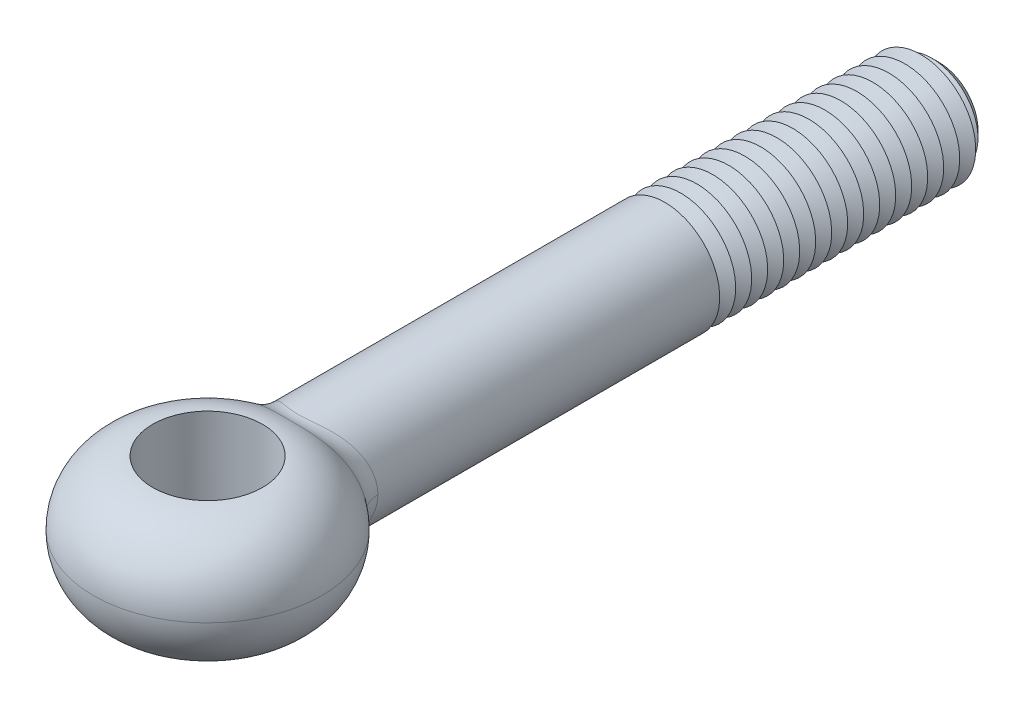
ISO-10303-21;
HEADER;
FILE_DESCRIPTION(('STEP AP214'),'2;1');
FILE_NAME('part.step','',(''),(''),'','','');
FILE_SCHEMA(('AUTOMOTIVE_DESIGN { 1 0 10303 214 1 1 1 1 }'));
ENDSEC;
DATA;
#1=APPLICATION_CONTEXT('core data for automotive mechanical design processes');
#2=APPLICATION_PROTOCOL_DEFINITION('international standard','automotive_design',2000,#1);
#3=PRODUCT_CONTEXT('',#1,'mechanical');
#4=PRODUCT('Part','Part','',(#3));
#5=PRODUCT_RELATED_PRODUCT_CATEGORY('part','',(#4));
#6=PRODUCT_DEFINITION_FORMATION('','',#4);
#7=PRODUCT_DEFINITION_CONTEXT('part definition',#1,'design');
#8=PRODUCT_DEFINITION('design','',#6,#7);
#9=PRODUCT_DEFINITION_SHAPE('','',#8);
#10=(LENGTH_UNIT() NAMED_UNIT(*) SI_UNIT(.MILLI.,.METRE.));
#11=(NAMED_UNIT(*) PLANE_ANGLE_UNIT() SI_UNIT($,.RADIAN.));
#12=(NAMED_UNIT(*) SI_UNIT($,.STERADIAN.) SOLID_ANGLE_UNIT());
#13=UNCERTAINTY_MEASURE_WITH_UNIT(LENGTH_MEASURE(1.E-05),#10,'distance_accuracy_value','');
#14=(GEOMETRIC_REPRESENTATION_CONTEXT(3) GLOBAL_UNCERTAINTY_ASSIGNED_CONTEXT((#13)) GLOBAL_UNIT_ASSIGNED_CONTEXT((#10,
#11,#12)) REPRESENTATION_CONTEXT('',''));
#15=CARTESIAN_POINT('',(0.,0.,0.));
#16=DIRECTION('',(0.,0.,1.));
#17=DIRECTION('',(1.,0.,0.));
#18=AXIS2_PLACEMENT_3D('',#15,#16,#17);
#19=CARTESIAN_POINT('',(0.,0.,-80.));
#20=DIRECTION('',(0.,0.,1.));
#21=DIRECTION('',(1.,0.,0.));
#22=AXIS2_PLACEMENT_3D('',#19,#20,#21);
#23=CYLINDRICAL_SURFACE('',#22,6.);
#24=CARTESIAN_POINT('',(0.,0.,-50.));
#25=DIRECTION('',(0.,0.,-1.));
#26=DIRECTION('',(-1.,0.,0.));
#27=AXIS2_PLACEMENT_3D('',#24,#25,#26);
#28=CIRCLE('',#27,6.);
#29=CARTESIAN_POINT('',(-6.,0.,-50.));
#30=VERTEX_POINT('',#29);
#31=EDGE_CURVE('E79',#30,#30,#28,.T.);
#32=ORIENTED_EDGE('',*,*,#31,.F.);
#33=EDGE_LOOP('',(#32));
#34=FACE_BOUND('',#33,.T.);
#35=CARTESIAN_POINT('',(5.9347688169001,-3.72936552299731,-9.76127797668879));
#36=CARTESIAN_POINT('',(5.01568840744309,-3.30684503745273,-10.6313747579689));
#37=CARTESIAN_POINT('',(4.83579180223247,-3.55177668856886,-11.9305846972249));
#38=CARTESIAN_POINT('',(6.04219931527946,-3.59564214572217,-9.79450956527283));
#39=CARTESIAN_POINT('',(5.09919553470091,-3.1795874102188,-10.6682119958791));
#40=CARTESIAN_POINT('',(4.92935060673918,-3.42442109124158,-11.9860495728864));
#41=CARTESIAN_POINT('',(6.1438473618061,-3.45763550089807,-9.82611020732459));
#42=CARTESIAN_POINT('',(5.17725322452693,-3.05002694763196,-10.702840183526));
#43=CARTESIAN_POINT('',(5.01812074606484,-3.29298619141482,-12.0386936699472));
#44=CARTESIAN_POINT('',(6.33498015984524,-3.17385997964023,-9.8857417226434));
#45=CARTESIAN_POINT('',(5.32290004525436,-2.78639390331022,-10.7677279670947));
#46=CARTESIAN_POINT('',(5.1853986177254,-3.02272379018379,-12.1378881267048));
#47=CARTESIAN_POINT('',(6.42446179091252,-3.02808912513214,-9.91377167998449));
#48=CARTESIAN_POINT('',(5.39041764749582,-2.65235488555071,-10.7979569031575));
#49=CARTESIAN_POINT('',(5.26390371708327,-2.88389440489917,-12.1844369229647));
#50=CARTESIAN_POINT('',(6.59063414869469,-2.72961135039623,-9.96594490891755));
#51=CARTESIAN_POINT('',(5.51491014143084,-2.38053035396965,-10.8538721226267));
#52=CARTESIAN_POINT('',(5.40994102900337,-2.5996298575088,-12.270973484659));
#53=CARTESIAN_POINT('',(6.66732079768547,-2.57690223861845,-9.99008694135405));
#54=CARTESIAN_POINT('',(5.57181683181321,-2.24279354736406,-10.8795284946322));
#55=CARTESIAN_POINT('',(5.47746974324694,-2.45419260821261,-12.3109591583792));
#56=CARTESIAN_POINT('',(6.80727548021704,-2.26566063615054,-10.0342164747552));
#57=CARTESIAN_POINT('',(5.67502497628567,-1.96438787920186,-10.9261769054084));
#58=CARTESIAN_POINT('',(5.60087770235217,-2.1577720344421,-12.3839763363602));
#59=CARTESIAN_POINT('',(6.87054514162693,-2.10712885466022,-10.0542044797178));
#60=CARTESIAN_POINT('',(5.72126980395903,-1.82378259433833,-10.9471437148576));
#61=CARTESIAN_POINT('',(5.65675836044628,-2.00678938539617,-12.4170086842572));
#62=CARTESIAN_POINT('',(7.03602672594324,-1.63406973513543,-10.1065323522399));
#63=CARTESIAN_POINT('',(5.84177866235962,-1.4066595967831,-11.0018788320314));
#64=CARTESIAN_POINT('',(5.80305576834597,-1.55625689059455,-12.5034220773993));
#65=CARTESIAN_POINT('',(7.11911563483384,-1.31267241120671,-10.1328771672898));
#66=CARTESIAN_POINT('',(5.90112324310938,-1.12766751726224,-11.0289752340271));
#67=CARTESIAN_POINT('',(5.87671572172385,-1.2501642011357,-12.5468355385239));
#68=CARTESIAN_POINT('',(7.23011866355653,-0.660856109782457,-10.1680856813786));
#69=CARTESIAN_POINT('',(5.98031743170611,-0.565466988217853,-11.0651706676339));
#70=CARTESIAN_POINT('',(5.97517391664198,-0.629386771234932,-12.6048310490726));
#71=CARTESIAN_POINT('',(7.25807152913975,-0.33044363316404,-10.1769616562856));
#72=CARTESIAN_POINT('',(6.00000388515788,-0.282923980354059,-11.0741952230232));
#73=CARTESIAN_POINT('',(6.0000064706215,-0.314708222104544,-12.6194333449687));
#74=CARTESIAN_POINT('',(7.25805738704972,0.335912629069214,-10.1769567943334));
#75=CARTESIAN_POINT('',(5.99999605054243,0.287606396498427,-11.0741911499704));
#76=CARTESIAN_POINT('',(5.99999342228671,0.319916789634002,-12.6194255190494));
#77=CARTESIAN_POINT('',(7.22915722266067,0.671857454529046,-10.1677796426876));
#78=CARTESIAN_POINT('',(5.97964504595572,0.574876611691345,-11.0648614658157));
#79=CARTESIAN_POINT('',(5.97431882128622,0.63986424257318,-12.6043279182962));
#80=CARTESIAN_POINT('',(7.11452740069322,1.33399050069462,-10.131423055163));
#81=CARTESIAN_POINT('',(5.89784251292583,1.14610230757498,-11.0274778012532));
#82=CARTESIAN_POINT('',(5.87264847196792,1.2704671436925,-12.5444393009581));
#83=CARTESIAN_POINT('',(7.02877559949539,1.66017486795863,-10.1042366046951));
#84=CARTESIAN_POINT('',(5.83657851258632,1.42936262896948,-10.9995093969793));
#85=CARTESIAN_POINT('',(5.79663311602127,1.58111892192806,-12.4996367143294));
#86=CARTESIAN_POINT('',(6.80343893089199,2.2930418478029,-10.0329875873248));
#87=CARTESIAN_POINT('',(5.67253761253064,1.98731296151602,-10.9250177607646));
#88=CARTESIAN_POINT('',(5.59744490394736,2.1838493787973,-12.3819651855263));
#89=CARTESIAN_POINT('',(6.66393326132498,2.59975238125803,-9.98894984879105));
#90=CARTESIAN_POINT('',(5.57019974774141,2.2614449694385,-10.8786920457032));
#91=CARTESIAN_POINT('',(5.47434142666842,2.47595464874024,-12.3091375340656));
#92=CARTESIAN_POINT('',(6.33535121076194,3.18625883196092,-9.88580293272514));
#93=CARTESIAN_POINT('',(5.32389744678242,2.79589244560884,-10.768093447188));
#94=CARTESIAN_POINT('',(5.18560859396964,3.03453222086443,-12.1380393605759));
#95=CARTESIAN_POINT('',(6.14627999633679,3.4660575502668,-9.82669532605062));
#96=CARTESIAN_POINT('',(5.18043230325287,3.05583228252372,-10.7040397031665));
#97=CARTESIAN_POINT('',(5.01998367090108,3.30100719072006,-12.0397714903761));
#98=CARTESIAN_POINT('',(5.7172577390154,4.00014270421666,-9.69400494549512));
#99=CARTESIAN_POINT('',(4.84766875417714,3.56284891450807,-10.5572649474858));
#100=CARTESIAN_POINT('',(4.64637499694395,3.8096597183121,-11.8183006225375));
#101=CARTESIAN_POINT('',(5.47601553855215,4.2534802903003,-9.62005911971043));
#102=CARTESIAN_POINT('',(4.65772328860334,3.80925143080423,-10.4742896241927));
#103=CARTESIAN_POINT('',(4.43732293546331,4.05093360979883,-11.694469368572));
#104=CARTESIAN_POINT('',(5.08259146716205,4.60342640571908,-9.50208552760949));
#105=CARTESIAN_POINT('',(4.34080391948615,4.15825147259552,-10.3388173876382));
#106=CARTESIAN_POINT('',(4.09924731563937,4.38421562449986,-11.4959320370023));
#107=CARTESIAN_POINT('',(4.9460782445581,4.71513594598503,-9.46155286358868));
#108=CARTESIAN_POINT('',(4.23020168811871,4.27084293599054,-10.2919789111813));
#109=CARTESIAN_POINT('',(3.98237779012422,4.49060566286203,-11.4275663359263));
#110=CARTESIAN_POINT('',(4.66296513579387,4.92813376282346,-9.37875537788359));
#111=CARTESIAN_POINT('',(3.99884628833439,4.48804462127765,-10.1953948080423));
#112=CARTESIAN_POINT('',(3.74115278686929,4.6934607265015,-11.2875507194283));
#113=CARTESIAN_POINT('',(4.5163679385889,5.0294247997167,-9.33649101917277));
#114=CARTESIAN_POINT('',(3.87815279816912,4.5926858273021,-10.1456674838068));
#115=CARTESIAN_POINT('',(3.61679930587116,4.78992838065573,-11.2159016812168));
#116=CARTESIAN_POINT('',(4.20225124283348,5.22831182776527,-9.24781094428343));
#117=CARTESIAN_POINT('',(3.61758964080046,4.80051594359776,-10.0403893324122));
#118=CARTESIAN_POINT('',(3.35180476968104,4.97934459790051,-11.0651470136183));
#119=CARTESIAN_POINT('',(4.03398632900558,5.3250780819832,-9.20131965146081));
#120=CARTESIAN_POINT('',(3.47696557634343,4.90311397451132,-9.98467073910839));
#121=CARTESIAN_POINT('',(3.21063957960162,5.07150293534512,-10.9858822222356));
#122=CARTESIAN_POINT('',(3.68652352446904,5.50578905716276,-9.10838168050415));
#123=CARTESIAN_POINT('',(3.18454628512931,5.09703954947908,-9.87225560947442));
#124=CARTESIAN_POINT('',(2.92111983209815,5.24360862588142,-10.8269291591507));
#125=CARTESIAN_POINT('',(3.50732357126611,5.5897313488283,-9.06193501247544));
#126=CARTESIAN_POINT('',(3.03278104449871,5.18843564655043,-9.81555489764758));
#127=CARTESIAN_POINT('',(2.77276391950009,5.32355366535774,-10.7472408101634));
#128=CARTESIAN_POINT('',(3.13794087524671,5.74446425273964,-8.97062224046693));
#129=CARTESIAN_POINT('',(2.71821702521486,5.35884982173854,-9.70314483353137));
#130=CARTESIAN_POINT('',(2.46931336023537,5.47091833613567,-10.5900722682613));
#131=CARTESIAN_POINT('',(2.94775184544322,5.81524723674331,-8.92575706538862));
#132=CARTESIAN_POINT('',(2.55541416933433,5.43794512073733,-9.64741385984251));
#133=CARTESIAN_POINT('',(2.31421486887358,5.53833070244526,-10.5125933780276));
#134=CARTESIAN_POINT('',(2.55657851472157,5.9431564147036,-8.83975050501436));
#135=CARTESIAN_POINT('',(2.21925064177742,5.58238081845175,-9.53980556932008));
#136=CARTESIAN_POINT('',(1.99786735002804,5.66014896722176,-10.3636052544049));
#137=CARTESIAN_POINT('',(2.35559801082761,6.00028737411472,-8.79860782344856));
#138=CARTESIAN_POINT('',(2.04585622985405,5.64781946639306,-9.48788433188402));
#139=CARTESIAN_POINT('',(1.83662049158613,5.71455940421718,-10.2920939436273));
#140=CARTESIAN_POINT('',(1.85774191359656,6.12093796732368,-8.70719486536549));
#141=CARTESIAN_POINT('',(1.61559271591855,5.78713197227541,-9.37194513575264));
#142=CARTESIAN_POINT('',(1.4406271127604,5.82946473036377,-10.1327613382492));
#143=CARTESIAN_POINT('',(1.55532271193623,6.17747996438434,-8.6600942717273));
#144=CARTESIAN_POINT('',(1.3529723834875,5.8538439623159,-9.31142342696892));
#145=CARTESIAN_POINT('',(1.20284157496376,5.88331425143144,-10.0502669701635));
#146=CARTESIAN_POINT('',(1.0891409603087,6.23930337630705,-8.60649289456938));
#147=CARTESIAN_POINT('',(0.947579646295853,5.92726352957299,-9.242285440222));
#148=CARTESIAN_POINT('',(0.83982684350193,5.94219369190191,-9.95617208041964));
#149=CARTESIAN_POINT('',(0.931962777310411,6.25606948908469,-8.59147969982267));
#150=CARTESIAN_POINT('',(0.810874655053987,5.94729550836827,-9.22285403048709));
#151=CARTESIAN_POINT('',(0.718001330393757,5.95816141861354,-9.92977025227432));
#152=CARTESIAN_POINT('',(0.614462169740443,6.2817502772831,-8.56819097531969));
#153=CARTESIAN_POINT('',(0.534722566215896,5.97803723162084,-9.19268813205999));
#154=CARTESIAN_POINT('',(0.472694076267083,5.98261931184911,-9.88878715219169));
#155=CARTESIAN_POINT('',(0.454140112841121,6.29066586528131,-8.5599146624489));
#156=CARTESIAN_POINT('',(0.395193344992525,5.98876738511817,-9.18193414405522));
#157=CARTESIAN_POINT('',(0.349212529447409,5.9911103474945,-9.87420450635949));
#158=CARTESIAN_POINT('',(0.131049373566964,6.30047562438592,-8.55079683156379));
#159=CARTESIAN_POINT('',(0.114068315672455,6.00056854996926,-9.17009294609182));
#160=CARTESIAN_POINT('',(0.100687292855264,6.00045297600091,-9.85813795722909));
#161=CARTESIAN_POINT('',(-0.0317286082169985,6.30131187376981,-8.55000899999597));
#162=CARTESIAN_POINT('',(-0.0276309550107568,6.00157787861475,-9.16906745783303));
#163=CARTESIAN_POINT('',(-0.02436125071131,6.00124940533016,-9.85674863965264));
#164=CARTESIAN_POINT('',(-0.356412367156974,6.29479284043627,-8.55608280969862));
#165=CARTESIAN_POINT('',(-0.31015318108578,5.99373179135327,-9.1769575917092));
#166=CARTESIAN_POINT('',(-0.274003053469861,5.9950408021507,-9.86745275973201));
#167=CARTESIAN_POINT('',(-0.518318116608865,6.28743729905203,-8.56294469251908));
#168=CARTESIAN_POINT('',(-0.451073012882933,5.98487067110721,-9.18587895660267));
#169=CARTESIAN_POINT('',(-0.398596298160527,5.98803552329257,-9.87954662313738));
#170=CARTESIAN_POINT('',(-0.839832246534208,6.26466677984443,-8.583729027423));
#171=CARTESIAN_POINT('',(-0.730746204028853,5.95757663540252,-9.21281914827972));
#172=CARTESIAN_POINT('',(-0.646718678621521,5.96634931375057,-9.91613502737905));
#173=CARTESIAN_POINT('',(-0.999430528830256,6.24922351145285,-8.59767625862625));
#174=CARTESIAN_POINT('',(-0.869577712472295,5.93909230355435,-9.23088715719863));
#175=CARTESIAN_POINT('',(-0.770242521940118,5.95164143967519,-9.94067308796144));
#176=CARTESIAN_POINT('',(-1.31437481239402,6.21055073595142,-8.63153922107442));
#177=CARTESIAN_POINT('',(-1.14330359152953,5.89311724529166,-9.27458059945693));
#178=CARTESIAN_POINT('',(-1.01506554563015,5.91481022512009,-10.0001513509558));
#179=CARTESIAN_POINT('',(-1.46971907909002,6.18731810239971,-8.65145734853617));
#180=CARTESIAN_POINT('',(-1.27826760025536,5.86559591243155,-9.30023316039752));
#181=CARTESIAN_POINT('',(-1.13636381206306,5.89268390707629,-10.0350957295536));
#182=CARTESIAN_POINT('',(-1.82539603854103,6.12454062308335,-8.70327656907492));
#183=CARTESIAN_POINT('',(-1.58698911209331,5.79180104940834,-9.36667644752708));
#184=CARTESIAN_POINT('',(-1.41557604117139,5.83289583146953,-10.1258248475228));
#185=CARTESIAN_POINT('',(-2.02378988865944,6.08214516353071,-8.73696553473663));
#186=CARTESIAN_POINT('',(-1.75893471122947,5.74230420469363,-9.40969592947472));
#187=CARTESIAN_POINT('',(-1.57246341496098,5.79251920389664,-10.184686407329));
#188=CARTESIAN_POINT('',(-2.41092164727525,5.98480792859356,-8.80979727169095));
#189=CARTESIAN_POINT('',(-2.09355200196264,5.63009686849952,-9.50199744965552));
#190=CARTESIAN_POINT('',(-1.880970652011,5.69981707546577,-10.3115469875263));
#191=CARTESIAN_POINT('',(-2.5996560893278,5.92986168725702,-8.84894198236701));
#192=CARTESIAN_POINT('',(-2.25629041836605,5.56730096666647,-9.55133195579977));
#193=CARTESIAN_POINT('',(-2.03258861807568,5.64748732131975,-10.3795492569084));
#194=CARTESIAN_POINT('',(-2.96755778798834,5.80783248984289,-8.93044371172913));
#195=CARTESIAN_POINT('',(-2.57232712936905,5.42968443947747,-9.65322105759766));
#196=CARTESIAN_POINT('',(-2.33036981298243,5.53126903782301,-10.5206862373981));
#197=CARTESIAN_POINT('',(-3.14671697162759,5.74073949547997,-8.97280337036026));
#198=CARTESIAN_POINT('',(-2.72564626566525,5.35477585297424,-9.70581299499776));
#199=CARTESIAN_POINT('',(-2.47652840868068,5.46737094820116,-10.593825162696));
#200=CARTESIAN_POINT('',(-3.49533769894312,5.59480022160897,-9.05896053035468));
#201=CARTESIAN_POINT('',(-3.02253770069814,5.19403391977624,-9.81188119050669));
#202=CARTESIAN_POINT('',(-2.76291205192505,5.32838116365,-10.742122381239));
#203=CARTESIAN_POINT('',(-3.66480050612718,5.51595547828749,-9.10275784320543));
#204=CARTESIAN_POINT('',(-3.16610934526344,5.10813119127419,-9.86537600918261));
#205=CARTESIAN_POINT('',(-2.90313787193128,5.2532909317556,-10.8172804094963));
#206=CARTESIAN_POINT('',(-3.99928684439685,5.34409495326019,-9.19187849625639));
#207=CARTESIAN_POINT('',(-3.44784552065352,4.92340384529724,-9.97329692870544));
#208=CARTESIAN_POINT('',(-3.18162491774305,5.08961424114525,-10.9697608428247));
#209=CARTESIAN_POINT('',(-4.16399459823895,5.25070632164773,-9.23720580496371));
#210=CARTESIAN_POINT('',(-3.58564022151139,4.82420269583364,-10.027694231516));
#211=CARTESIAN_POINT('',(-3.31967954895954,5.00067268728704,-11.0470755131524));
#212=CARTESIAN_POINT('',(-4.48282170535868,5.05207061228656,-9.32687019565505));
#213=CARTESIAN_POINT('',(-3.85050097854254,4.61613017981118,-10.1343299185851));
#214=CARTESIAN_POINT('',(-3.58838451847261,4.8114958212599,-11.1995795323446));
#215=CARTESIAN_POINT('',(-4.63694077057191,4.94682321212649,-9.37120725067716));
#216=CARTESIAN_POINT('',(-3.97751767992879,4.50720729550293,-10.1865592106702));
#217=CARTESIAN_POINT('',(-3.71903465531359,4.71126020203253,-11.2747688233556));
#218=CARTESIAN_POINT('',(-4.93402321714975,4.72498798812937,-9.45797232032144));
#219=CARTESIAN_POINT('',(-4.22045615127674,4.28075328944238,-10.2878502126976));
#220=CARTESIAN_POINT('',(-3.97205735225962,4.49998856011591,-11.421526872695));
#221=CARTESIAN_POINT('',(-5.0769962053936,4.60841012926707,-9.50040196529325));
#222=CARTESIAN_POINT('',(-4.33632375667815,4.16319510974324,-10.3368953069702));
#223=CARTESIAN_POINT('',(-4.09443702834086,4.38896202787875,-11.4930987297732));
#224=CARTESIAN_POINT('',(-5.35139946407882,4.36431803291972,-9.58269705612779));
#225=CARTESIAN_POINT('',(-4.55686646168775,3.92030762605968,-10.4311837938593));
#226=CARTESIAN_POINT('',(-4.3302405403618,4.15649336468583,-11.6315929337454));
#227=CARTESIAN_POINT('',(-5.48282554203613,4.2367998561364,-9.62256156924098));
#228=CARTESIAN_POINT('',(-4.66146230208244,3.79496029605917,-10.476398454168));
#229=CARTESIAN_POINT('',(-4.44366112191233,4.03504748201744,-11.6985135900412));
#230=CARTESIAN_POINT('',(-5.73992249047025,3.96459248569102,-9.70111653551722));
#231=CARTESIAN_POINT('',(-4.86435688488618,3.53075699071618,-10.5647509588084));
#232=CARTESIAN_POINT('',(-4.66626199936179,3.77580236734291,-11.8301121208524));
#233=CARTESIAN_POINT('',(-5.86493730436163,3.81935492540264,-9.73963775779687));
#234=CARTESIAN_POINT('',(-4.96192595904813,3.39157605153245,-10.6076101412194));
#235=CARTESIAN_POINT('',(-4.77491394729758,3.6374808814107,-11.894491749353));
#236=CARTESIAN_POINT('',(-6.10049317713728,3.5184514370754,-9.81259595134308));
#237=CARTESIAN_POINT('',(-5.14414695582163,3.10685040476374,-10.6881097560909));
#238=CARTESIAN_POINT('',(-4.98021019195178,3.35090613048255,-12.0161983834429));
#239=CARTESIAN_POINT('',(-6.21103492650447,3.36278600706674,-9.84703311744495));
#240=CARTESIAN_POINT('',(-5.22870245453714,2.96133570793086,-10.7257098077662));
#241=CARTESIAN_POINT('',(-5.07685506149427,3.20265333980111,-12.0735257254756));
#242=CARTESIAN_POINT('',(-6.41684087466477,3.04200182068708,-9.91136789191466));
#243=CARTESIAN_POINT('',(-5.38481615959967,2.66492089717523,-10.7954268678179));
#244=CARTESIAN_POINT('',(-5.25718892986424,2.89714459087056,-12.1804567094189));
#245=CARTESIAN_POINT('',(-6.51209487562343,2.87687685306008,-9.941262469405));
#246=CARTESIAN_POINT('',(-5.45627120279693,2.51407150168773,-10.8274993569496));
#247=CARTESIAN_POINT('',(-5.34086927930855,2.73988271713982,-12.230055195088));
#248=CARTESIAN_POINT('',(-6.68634060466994,2.53862818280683,-9.99606907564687));
#249=CARTESIAN_POINT('',(-5.58600966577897,2.20820283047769,-10.8859198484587));
#250=CARTESIAN_POINT('',(-5.49420876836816,2.41774112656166,-12.3208709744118));
#251=CARTESIAN_POINT('',(-6.7653416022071,2.365509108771,-10.0209839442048));
#252=CARTESIAN_POINT('',(-5.64421437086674,2.05326176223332,-10.9122330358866));
#253=CARTESIAN_POINT('',(-5.56387589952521,2.25286581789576,-12.3620930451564));
#254=CARTESIAN_POINT('',(-6.90530331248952,2.01532499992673,-10.0651851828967));
#255=CARTESIAN_POINT('',(-5.7466982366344,1.74251049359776,-10.9586742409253));
#256=CARTESIAN_POINT('',(-5.68746016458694,1.91935714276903,-12.4351539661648));
#257=CARTESIAN_POINT('',(-6.96652294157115,1.83836168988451,-10.0845522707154));
#258=CARTESIAN_POINT('',(-5.79110883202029,1.58683531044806,-10.9788602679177));
#259=CARTESIAN_POINT('',(-5.74160317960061,1.75082065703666,-12.4671274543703));
#260=CARTESIAN_POINT('',(-7.07189656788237,1.47955191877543,-10.1179144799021));
#261=CARTESIAN_POINT('',(-5.86721134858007,1.27322299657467,-11.0135080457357));
#262=CARTESIAN_POINT('',(-5.83487815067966,1.40909706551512,-12.5221684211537));
#263=CARTESIAN_POINT('',(-7.11605858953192,1.29770779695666,-10.1319121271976));
#264=CARTESIAN_POINT('',(-5.89885329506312,1.11539297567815,-11.02794716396));
#265=CARTESIAN_POINT('',(-5.87401716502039,1.2359121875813,-12.5452400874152));
#266=CARTESIAN_POINT('',(-7.18688145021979,0.930719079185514,-10.1543694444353));
#267=CARTESIAN_POINT('',(-5.9494736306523,0.79823853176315,-11.0510690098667));
#268=CARTESIAN_POINT('',(-5.93681662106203,0.886399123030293,-12.5822406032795));
#269=CARTESIAN_POINT('',(-7.21355030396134,0.745576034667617,-10.1628316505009));
#270=CARTESIAN_POINT('',(-5.9684191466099,0.639031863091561,-11.0597367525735));
#271=CARTESIAN_POINT('',(-5.96048415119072,0.710072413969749,-12.5961736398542));
#272=CARTESIAN_POINT('',(-7.24914599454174,0.373651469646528,-10.1741279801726));
#273=CARTESIAN_POINT('',(-5.99369065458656,0.319847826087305,-11.0713030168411));
#274=CARTESIAN_POINT('',(-5.99208005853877,0.355858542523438,-12.6147701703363));
#275=CARTESIAN_POINT('',(-7.25807450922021,0.186870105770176,-10.1769626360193));
#276=CARTESIAN_POINT('',(-5.999998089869,0.159994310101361,-11.074193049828));
#277=CARTESIAN_POINT('',(-6.00000992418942,0.17797152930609,-12.6194345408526));
#278=CARTESIAN_POINT('',(-7.25804656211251,-0.335738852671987,-10.1769531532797));
#279=CARTESIAN_POINT('',(-6.0000034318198,-0.287452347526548,-11.0741934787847));
#280=CARTESIAN_POINT('',(-5.99998216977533,-0.31975128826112,-12.6194203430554));
#281=CARTESIAN_POINT('',(-7.22917576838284,-0.671764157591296,-10.1677860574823));
#282=CARTESIAN_POINT('',(-5.97966209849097,-0.574787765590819,-11.0648695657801));
#283=CARTESIAN_POINT('',(-5.97433528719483,-0.639775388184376,-12.6043385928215));
#284=CARTESIAN_POINT('',(-7.1145105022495,-1.33407428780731,-10.1314171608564));
#285=CARTESIAN_POINT('',(-5.8978267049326,-1.14618252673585,-11.0274702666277));
#286=CARTESIAN_POINT('',(-5.8726334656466,-1.27054694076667,-12.5444294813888));
#287=CARTESIAN_POINT('',(-7.02869303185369,-1.66035512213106,-10.1042080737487));
#288=CARTESIAN_POINT('',(-5.83651996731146,-1.42954497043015,-10.999480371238));
#289=CARTESIAN_POINT('',(-5.79655816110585,-1.58129059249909,-12.4995901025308));
#290=CARTESIAN_POINT('',(-6.85971870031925,-2.13500368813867,-10.0507838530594));
#291=CARTESIAN_POINT('',(-5.71335936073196,-1.84847480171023,-10.9435562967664));
#292=CARTESIAN_POINT('',(-5.64719485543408,-2.03333684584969,-12.411356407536));
#293=CARTESIAN_POINT('',(-6.79670689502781,-2.29072029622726,-10.0308806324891));
#294=CARTESIAN_POINT('',(-5.66726413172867,-1.98670630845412,-10.9226633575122));
#295=CARTESIAN_POINT('',(-5.59155053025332,-2.18163837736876,-12.3784603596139));
#296=CARTESIAN_POINT('',(-6.65771758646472,-2.59645969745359,-9.98706290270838));
#297=CARTESIAN_POINT('',(-5.56469443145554,-2.26041067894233,-10.8763159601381));
#298=CARTESIAN_POINT('',(-5.46901133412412,-2.47281875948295,-12.3059514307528));
#299=CARTESIAN_POINT('',(-6.58173903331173,-2.74648202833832,-9.96314806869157));
#300=CARTESIAN_POINT('',(-5.50827469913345,-2.395823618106,-10.8508858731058));
#301=CARTESIAN_POINT('',(-5.40211555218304,-2.61569716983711,-12.2663380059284));
#302=CARTESIAN_POINT('',(-6.41741234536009,-3.03976673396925,-9.91156293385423));
#303=CARTESIAN_POINT('',(-5.38510014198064,-2.6630812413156,-10.7955752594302));
#304=CARTESIAN_POINT('',(-5.25771751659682,-2.89501593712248,-12.180769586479));
#305=CARTESIAN_POINT('',(-6.32906900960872,-3.18303170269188,-9.88389409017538));
#306=CARTESIAN_POINT('',(-5.3184112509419,-2.79488018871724,-10.7657236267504));
#307=CARTESIAN_POINT('',(-5.18021937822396,-3.03145876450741,-12.1348170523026));
#308=CARTESIAN_POINT('',(-6.14060484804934,-3.46203414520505,-9.82510194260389));
#309=CARTESIAN_POINT('',(-5.17475790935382,-3.05416625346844,-10.7017329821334));
#310=CARTESIAN_POINT('',(-5.01528894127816,-3.29717537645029,-12.0370139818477));
#311=CARTESIAN_POINT('',(-6.0404865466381,-3.5977732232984,-9.79397937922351));
#312=CARTESIAN_POINT('',(-5.09786126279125,-3.18162147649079,-10.6676230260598));
#313=CARTESIAN_POINT('',(-4.92785877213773,-3.42645068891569,-11.9851647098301));
#314=CARTESIAN_POINT('',(-5.9347688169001,-3.72936552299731,-9.76127797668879));
#315=CARTESIAN_POINT('',(-5.01568840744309,-3.30684503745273,-10.6313747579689));
#316=CARTESIAN_POINT('',(-4.83579180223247,-3.55177668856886,-11.9305846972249));
#317=(BOUNDED_SURFACE() B_SPLINE_SURFACE(3,2,((#35,#36,#37),(#38,#39,#40),(#41,#42,#43),(#44,
#45,#46),(#47,#48,#49),(#50,#51,#52),(#53,#54,#55),(#56,#57,#58),(#59,#60,#61),(#62,#63,#64),
(#65,#66,#67),(#68,#69,#70),(#71,#72,#73),(#74,#75,#76),(#77,#78,#79),(#80,#81,#82),(#83,#84,
#85),(#86,#87,#88),(#89,#90,#91),(#92,#93,#94),(#95,#96,#97),(#98,#99,#100),(#101,#102,#103),
(#104,#105,#106),(#107,#108,#109),(#110,#111,#112),(#113,#114,#115),(#116,#117,#118),(#119,#120,
#121),(#122,#123,#124),(#125,#126,#127),(#128,#129,#130),(#131,#132,#133),(#134,#135,#136),
(#137,#138,#139),(#140,#141,#142),(#143,#144,#145),(#146,#147,#148),(#149,#150,#151),(#152,#153,
#154),(#155,#156,#157),(#158,#159,#160),(#161,#162,#163),(#164,#165,#166),(#167,#168,#169),
(#170,#171,#172),(#173,#174,#175),(#176,#177,#178),(#179,#180,#181),(#182,#183,#184),(#185,#186,
#187),(#188,#189,#190),(#191,#192,#193),(#194,#195,#196),(#197,#198,#199),(#200,#201,#202),
(#203,#204,#205),(#206,#207,#208),(#209,#210,#211),(#212,#213,#214),(#215,#216,#217),(#218,#219,
#220),(#221,#222,#223),(#224,#225,#226),(#227,#228,#229),(#230,#231,#232),(#233,#234,#235),
(#236,#237,#238),(#239,#240,#241),(#242,#243,#244),(#245,#246,#247),(#248,#249,#250),(#251,#252,
#253),(#254,#255,#256),(#257,#258,#259),(#260,#261,#262),(#263,#264,#265),(#266,#267,#268),
(#269,#270,#271),(#272,#273,#274),(#275,#276,#277),(#278,#279,#280),(#281,#282,#283),(#284,#285,
#286),(#287,#288,#289),(#290,#291,#292),(#293,#294,#295),(#296,#297,#298),(#299,#300,#301),
(#302,#303,#304),(#305,#306,#307),(#308,#309,#310),(#311,#312,#313),(#314,#315,#316)),
.UNSPECIFIED.,.F.,.F.,.F.) B_SPLINE_SURFACE_WITH_KNOTS((4,2,2,2,2,2,2,2,2,2,2,2,2,2,2,2,2,2,2,2,
2,2,2,2,2,2,2,2,2,2,2,2,2,2,2,2,2,2,2,2,2,2,2,2,2,2,4),(3,3),(0.,0.730157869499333,
1.46050265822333,2.19107976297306,2.92156817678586,4.33710286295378,5.75164245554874,
7.18959333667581,8.62810462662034,10.0645045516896,11.5007548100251,12.9777469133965,
13.7173286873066,14.4567140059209,15.2508784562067,16.0451931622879,16.8399668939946,
17.6344627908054,18.7545699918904,19.3125249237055,19.8704149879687,20.4323016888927,
20.9942061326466,21.5580893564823,22.1221991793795,22.8711633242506,23.6203943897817,
24.3702474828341,25.1200026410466,25.8937593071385,26.6675370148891,27.440640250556,
28.214023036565,29.0276778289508,29.8412937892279,30.6554502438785,31.4691410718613,
32.2703098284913,33.0711012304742,33.8715254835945,34.6718740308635,36.109814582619,
37.5483362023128,38.2672339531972,38.986189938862,39.7048676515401,40.4233915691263),(0.,1.),
.UNSPECIFIED.) GEOMETRIC_REPRESENTATION_ITEM() RATIONAL_B_SPLINE_SURFACE(((1.,0.913704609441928,
1.),(1.,0.911808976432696,1.),(1.,0.909987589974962,1.),(1.,0.906521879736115,1.),(1.,
0.904877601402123,1.),(1.,0.901795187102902,1.),(1.,0.900357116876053,1.),(1.,0.897712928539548,
1.),(1.,0.896506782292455,1.),(1.,0.893335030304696,1.),(1.,0.891717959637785,1.),(1.,
0.889551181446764,1.),(1.,0.889000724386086,1.),(1.,0.88900105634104,1.),(1.,0.889570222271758,
1.),(1.,0.891807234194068,1.),(1.,0.893475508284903,1.),(1.,0.897791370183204,1.),(1.,
0.900437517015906,1.),(1.,0.90652846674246,1.),(1.,0.909973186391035,1.),(1.,0.917541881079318,
1.),(1.,0.921682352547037,1.),(1.,0.928122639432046,1.),(1.,0.930309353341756,1.),(1.,
0.934718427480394,1.),(1.,0.936940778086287,1.),(1.,0.941540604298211,1.),(1.,0.943917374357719,
1.),(1.,0.948597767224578,1.),(1.,0.9509013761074,1.),(1.,0.955362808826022,1.),(1.,
0.957520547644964,1.),(1.,0.961598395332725,1.),(1.,0.963518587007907,1.),(1.,0.967731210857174,
1.),(1.,0.969853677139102,1.),(1.,0.972244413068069,1.),(1.,0.972908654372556,1.),(1.,
0.973935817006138,1.),(1.,0.97429877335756,1.),(1.,0.974698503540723,1.),(1.,0.974732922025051,
1.),(1.,0.974466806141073,1.),(1.,0.974166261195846,1.),(1.,0.973250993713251,1.),(1.,
0.972635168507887,1.),(1.,0.9711286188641,1.),(1.,0.970237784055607,1.),(1.,0.967898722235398,
1.),(1.,0.966363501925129,1.),(1.,0.962996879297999,1.),(1.,0.961165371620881,1.),(1.,
0.957295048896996,1.),(1.,0.955256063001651,1.),(1.,0.951046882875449,1.),(1.,0.948876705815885,
1.),(1.,0.944396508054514,1.),(1.,0.942084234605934,1.),(1.,0.937444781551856,1.),(1.,
0.935117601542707,1.),(1.,0.93050246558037,1.),(1.,0.928214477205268,1.),(1.,0.923722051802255,
1.),(1.,0.921517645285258,1.),(1.,0.917125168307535,1.),(1.,0.914943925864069,1.),(1.,
0.910769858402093,1.),(1.,0.90877702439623,1.),(1.,0.905020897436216,1.),(1.,0.903257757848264,
1.),(1.,0.900001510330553,1.),(1.,0.898508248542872,1.),(1.,0.895843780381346,1.),(1.,
0.894667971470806,1.),(1.,0.892634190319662,1.),(1.,0.891776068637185,1.),(1.,0.890395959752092,
1.),(1.,0.889873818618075,1.),(1.,0.889176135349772,1.),(1.,0.889000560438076,1.),(1.,
0.889001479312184,1.),(1.,0.889569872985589,1.),(1.,0.89180755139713,1.),(1.,0.893477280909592,
1.),(1.,0.896713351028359,1.),(1.,0.897913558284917,1.),(1.,0.900537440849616,1.),(1.,
0.901961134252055,1.),(1.,0.905007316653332,1.),(1.,0.906629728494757,1.),(1.,0.910045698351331,
1.),(1.,0.911839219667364,1.),(1.,0.913704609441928,1.))) REPRESENTATION_ITEM('') SURFACE());
#318=CARTESIAN_POINT('',(-4.83579180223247,-3.55177668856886,-11.9305846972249));
#319=CARTESIAN_POINT('',(-4.92785877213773,-3.42645068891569,-11.9851647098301));
#320=CARTESIAN_POINT('',(-5.01528894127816,-3.29717537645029,-12.0370139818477));
#321=CARTESIAN_POINT('',(-5.18021937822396,-3.03145876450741,-12.1348170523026));
#322=CARTESIAN_POINT('',(-5.25771751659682,-2.89501593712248,-12.180769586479));
#323=CARTESIAN_POINT('',(-5.40211555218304,-2.61569716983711,-12.2663380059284));
#324=CARTESIAN_POINT('',(-5.46901133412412,-2.47281875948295,-12.3059514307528));
#325=CARTESIAN_POINT('',(-5.59155053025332,-2.18163837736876,-12.3784603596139));
#326=CARTESIAN_POINT('',(-5.64719485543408,-2.03333684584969,-12.411356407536));
#327=CARTESIAN_POINT('',(-5.79655816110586,-1.5812905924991,-12.4995901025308));
#328=CARTESIAN_POINT('',(-5.8726334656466,-1.27054694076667,-12.5444294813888));
#329=CARTESIAN_POINT('',(-5.97433528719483,-0.639775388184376,-12.6043385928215));
#330=CARTESIAN_POINT('',(-5.99998216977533,-0.31975128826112,-12.6194203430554));
#331=CARTESIAN_POINT('',(-6.00000992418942,0.17797152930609,-12.6194345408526));
#332=CARTESIAN_POINT('',(-5.99208005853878,0.355858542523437,-12.6147701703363));
#333=CARTESIAN_POINT('',(-5.96048415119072,0.71007241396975,-12.5961736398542));
#334=CARTESIAN_POINT('',(-5.93681662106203,0.886399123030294,-12.5822406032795));
#335=CARTESIAN_POINT('',(-5.87401716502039,1.2359121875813,-12.5452400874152));
#336=CARTESIAN_POINT('',(-5.83487815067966,1.40909706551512,-12.5221684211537));
#337=CARTESIAN_POINT('',(-5.74160317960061,1.75082065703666,-12.4671274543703));
#338=CARTESIAN_POINT('',(-5.68746016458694,1.91935714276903,-12.4351539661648));
#339=CARTESIAN_POINT('',(-5.56387589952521,2.25286581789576,-12.3620930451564));
#340=CARTESIAN_POINT('',(-5.49420876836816,2.41774112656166,-12.3208709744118));
#341=CARTESIAN_POINT('',(-5.34086927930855,2.73988271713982,-12.230055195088));
#342=CARTESIAN_POINT('',(-5.25718892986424,2.89714459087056,-12.1804567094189));
#343=CARTESIAN_POINT('',(-5.07685506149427,3.20265333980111,-12.0735257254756));
#344=CARTESIAN_POINT('',(-4.98021019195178,3.35090613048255,-12.0161983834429));
#345=CARTESIAN_POINT('',(-4.77491394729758,3.6374808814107,-11.894491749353));
#346=CARTESIAN_POINT('',(-4.66626199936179,3.77580236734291,-11.8301121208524));
#347=CARTESIAN_POINT('',(-4.44366112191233,4.03504748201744,-11.6985135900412));
#348=CARTESIAN_POINT('',(-4.3302405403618,4.15649336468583,-11.6315929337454));
#349=CARTESIAN_POINT('',(-4.09443702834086,4.38896202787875,-11.4930987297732));
#350=CARTESIAN_POINT('',(-3.97205735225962,4.49998856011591,-11.421526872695));
#351=CARTESIAN_POINT('',(-3.71903465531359,4.71126020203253,-11.2747688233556));
#352=CARTESIAN_POINT('',(-3.58838451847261,4.8114958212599,-11.1995795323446));
#353=CARTESIAN_POINT('',(-3.31967954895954,5.00067268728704,-11.0470755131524));
#354=CARTESIAN_POINT('',(-3.18162491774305,5.08961424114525,-10.9697608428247));
#355=CARTESIAN_POINT('',(-2.90313787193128,5.2532909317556,-10.8172804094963));
#356=CARTESIAN_POINT('',(-2.76291205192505,5.32838116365,-10.742122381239));
#357=CARTESIAN_POINT('',(-2.47652840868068,5.46737094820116,-10.593825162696));
#358=CARTESIAN_POINT('',(-2.33036981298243,5.53126903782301,-10.5206862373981));
#359=CARTESIAN_POINT('',(-2.03258861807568,5.64748732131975,-10.3795492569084));
#360=CARTESIAN_POINT('',(-1.880970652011,5.69981707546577,-10.3115469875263));
#361=CARTESIAN_POINT('',(-1.57246341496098,5.79251920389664,-10.184686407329));
#362=CARTESIAN_POINT('',(-1.41557604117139,5.83289583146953,-10.1258248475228));
#363=CARTESIAN_POINT('',(-1.13636381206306,5.89268390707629,-10.0350957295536));
#364=CARTESIAN_POINT('',(-1.01506554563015,5.91481022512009,-10.0001513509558));
#365=CARTESIAN_POINT('',(-0.770242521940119,5.95164143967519,-9.94067308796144));
#366=CARTESIAN_POINT('',(-0.64671867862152,5.96634931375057,-9.91613502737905));
#367=CARTESIAN_POINT('',(-0.398596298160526,5.98803552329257,-9.87954662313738));
#368=CARTESIAN_POINT('',(-0.274003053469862,5.9950408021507,-9.86745275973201));
#369=CARTESIAN_POINT('',(-0.0243612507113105,6.00124940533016,-9.85674863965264));
#370=CARTESIAN_POINT('',(0.100687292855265,6.00045297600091,-9.85813795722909));
#371=CARTESIAN_POINT('',(0.34921252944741,5.9911103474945,-9.87420450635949));
#372=CARTESIAN_POINT('',(0.472694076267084,5.98261931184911,-9.88878715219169));
#373=CARTESIAN_POINT('',(0.718001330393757,5.95816141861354,-9.92977025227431));
#374=CARTESIAN_POINT('',(0.83982684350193,5.94219369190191,-9.95617208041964));
#375=CARTESIAN_POINT('',(1.20284157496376,5.88331425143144,-10.0502669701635));
#376=CARTESIAN_POINT('',(1.4406271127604,5.82946473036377,-10.1327613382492));
#377=CARTESIAN_POINT('',(1.83662049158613,5.71455940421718,-10.2920939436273));
#378=CARTESIAN_POINT('',(1.99786735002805,5.66014896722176,-10.3636052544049));
#379=CARTESIAN_POINT('',(2.31421486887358,5.53833070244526,-10.5125933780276));
#380=CARTESIAN_POINT('',(2.46931336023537,5.47091833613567,-10.5900722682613));
#381=CARTESIAN_POINT('',(2.77276391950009,5.32355366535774,-10.7472408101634));
#382=CARTESIAN_POINT('',(2.92111983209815,5.24360862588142,-10.8269291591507));
#383=CARTESIAN_POINT('',(3.21063957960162,5.07150293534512,-10.9858822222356));
#384=CARTESIAN_POINT('',(3.35180476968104,4.97934459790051,-11.0651470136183));
#385=CARTESIAN_POINT('',(3.61679930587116,4.78992838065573,-11.2159016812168));
#386=CARTESIAN_POINT('',(3.74115278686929,4.6934607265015,-11.2875507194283));
#387=CARTESIAN_POINT('',(3.98237779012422,4.49060566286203,-11.4275663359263));
#388=CARTESIAN_POINT('',(4.09924731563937,4.38421562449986,-11.4959320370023));
#389=CARTESIAN_POINT('',(4.43732293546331,4.05093360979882,-11.694469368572));
#390=CARTESIAN_POINT('',(4.64637499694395,3.8096597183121,-11.8183006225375));
#391=CARTESIAN_POINT('',(5.01998367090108,3.30100719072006,-12.0397714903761));
#392=CARTESIAN_POINT('',(5.18560859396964,3.03453222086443,-12.1380393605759));
#393=CARTESIAN_POINT('',(5.47434142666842,2.47595464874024,-12.3091375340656));
#394=CARTESIAN_POINT('',(5.59744490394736,2.1838493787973,-12.3819651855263));
#395=CARTESIAN_POINT('',(5.79663311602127,1.58111892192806,-12.4996367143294));
#396=CARTESIAN_POINT('',(5.87264847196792,1.2704671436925,-12.5444393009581));
#397=CARTESIAN_POINT('',(5.97431882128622,0.63986424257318,-12.6043279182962));
#398=CARTESIAN_POINT('',(5.99999342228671,0.319916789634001,-12.6194255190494));
#399=CARTESIAN_POINT('',(6.0000064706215,-0.314708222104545,-12.6194333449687));
#400=CARTESIAN_POINT('',(5.97517391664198,-0.629386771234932,-12.6048310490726));
#401=CARTESIAN_POINT('',(5.87671572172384,-1.2501642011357,-12.5468355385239));
#402=CARTESIAN_POINT('',(5.80305576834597,-1.55625689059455,-12.5034220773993));
#403=CARTESIAN_POINT('',(5.65675836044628,-2.00678938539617,-12.4170086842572));
#404=CARTESIAN_POINT('',(5.60087770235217,-2.1577720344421,-12.3839763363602));
#405=CARTESIAN_POINT('',(5.47746974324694,-2.45419260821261,-12.3109591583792));
#406=CARTESIAN_POINT('',(5.40994102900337,-2.5996298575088,-12.270973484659));
#407=CARTESIAN_POINT('',(5.26390371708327,-2.88389440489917,-12.1844369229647));
#408=CARTESIAN_POINT('',(5.1853986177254,-3.02272379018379,-12.1378881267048));
#409=CARTESIAN_POINT('',(5.01812074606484,-3.29298619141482,-12.0386936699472));
#410=CARTESIAN_POINT('',(4.92935060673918,-3.42442109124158,-11.9860495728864));
#411=CARTESIAN_POINT('',(4.83579180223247,-3.55177668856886,-11.9305846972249));
#412=B_SPLINE_CURVE_WITH_KNOTS('',3,(#318,#319,#320,#321,#322,#323,#324,#325,#326,#327,#328,
#329,#330,#331,#332,#333,#334,#335,#336,#337,#338,#339,#340,#341,#342,#343,#344,#345,#346,#347,
#348,#349,#350,#351,#352,#353,#354,#355,#356,#357,#358,#359,#360,#361,#362,#363,#364,#365,#366,
#367,#368,#369,#370,#371,#372,#373,#374,#375,#376,#377,#378,#379,#380,#381,#382,#383,#384,#385,
#386,#387,#388,#389,#390,#391,#392,#393,#394,#395,#396,#397,#398,#399,#400,#401,#402,#403,#404,
#405,#406,#407,#408,#409,#410,#411),.UNSPECIFIED.,.F.,.F.,(4,2,2,2,2,2,2,2,2,2,2,2,2,2,2,2,2,2,
2,2,2,2,2,2,2,2,2,2,2,2,2,2,2,2,2,2,2,2,2,2,2,2,2,2,2,2,4),(0.,0.718523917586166,
1.43720163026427,2.15615761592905,2.87505536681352,4.31357698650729,5.7515175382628,
6.55186608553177,7.35229033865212,8.15308174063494,8.95425049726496,9.76794132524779,
10.5820977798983,11.3957137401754,12.2093685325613,12.9827513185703,13.7558545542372,
14.5296322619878,15.3033889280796,16.0531440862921,16.8029971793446,17.5522282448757,
18.3011923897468,18.865302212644,19.4291854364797,19.9910898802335,20.5529765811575,
21.1108666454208,21.6688215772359,22.7889287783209,23.5834246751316,24.3781984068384,
25.1725131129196,25.9666775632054,26.7060628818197,27.4456446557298,28.9226367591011,
30.3588870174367,31.7952869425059,33.2337982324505,34.6717491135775,36.0862887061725,
37.5018233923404,38.2323118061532,38.9628889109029,39.6932336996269,40.4233915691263),.UNSPECIFIED.);
#413=CARTESIAN_POINT('',(-6.,0.,-12.619429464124));
#414=VERTEX_POINT('',#413);
#415=CARTESIAN_POINT('',(6.,0.,-12.619429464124));
#416=VERTEX_POINT('',#415);
#417=EDGE_CURVE('E81',#414,#416,#412,.T.);
#418=ORIENTED_EDGE('',*,*,#417,.T.);
#419=CARTESIAN_POINT('',(-5.9347688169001,3.72936552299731,-9.76127797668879));
#420=CARTESIAN_POINT('',(-5.01568840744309,3.30684503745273,-10.6313747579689));
#421=CARTESIAN_POINT('',(-4.83579180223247,3.55177668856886,-11.9305846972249));
#422=CARTESIAN_POINT('',(-6.04219931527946,3.59564214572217,-9.79450956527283));
#423=CARTESIAN_POINT('',(-5.09919553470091,3.1795874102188,-10.6682119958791));
#424=CARTESIAN_POINT('',(-4.92935060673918,3.42442109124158,-11.9860495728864));
#425=CARTESIAN_POINT('',(-6.1438473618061,3.45763550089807,-9.82611020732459));
#426=CARTESIAN_POINT('',(-5.17725322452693,3.05002694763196,-10.702840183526));
#427=CARTESIAN_POINT('',(-5.01812074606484,3.29298619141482,-12.0386936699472));
#428=CARTESIAN_POINT('',(-6.33498015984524,3.17385997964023,-9.8857417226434));
#429=CARTESIAN_POINT('',(-5.32290004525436,2.78639390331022,-10.7677279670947));
#430=CARTESIAN_POINT('',(-5.1853986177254,3.02272379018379,-12.1378881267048));
#431=CARTESIAN_POINT('',(-6.42446179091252,3.02808912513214,-9.91377167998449));
#432=CARTESIAN_POINT('',(-5.39041764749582,2.65235488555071,-10.7979569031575));
#433=CARTESIAN_POINT('',(-5.26390371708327,2.88389440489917,-12.1844369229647));
#434=CARTESIAN_POINT('',(-6.59063414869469,2.72961135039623,-9.96594490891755));
#435=CARTESIAN_POINT('',(-5.51491014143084,2.38053035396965,-10.8538721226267));
#436=CARTESIAN_POINT('',(-5.40994102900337,2.5996298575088,-12.270973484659));
#437=CARTESIAN_POINT('',(-6.66732079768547,2.57690223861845,-9.99008694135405));
#438=CARTESIAN_POINT('',(-5.57181683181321,2.24279354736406,-10.8795284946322));
#439=CARTESIAN_POINT('',(-5.47746974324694,2.45419260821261,-12.3109591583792));
#440=CARTESIAN_POINT('',(-6.80727548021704,2.26566063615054,-10.0342164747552));
#441=CARTESIAN_POINT('',(-5.67502497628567,1.96438787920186,-10.9261769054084));
#442=CARTESIAN_POINT('',(-5.60087770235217,2.1577720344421,-12.3839763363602));
#443=CARTESIAN_POINT('',(-6.87054514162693,2.10712885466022,-10.0542044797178));
#444=CARTESIAN_POINT('',(-5.72126980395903,1.82378259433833,-10.9471437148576));
#445=CARTESIAN_POINT('',(-5.65675836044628,2.00678938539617,-12.4170086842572));
#446=CARTESIAN_POINT('',(-7.03602672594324,1.63406973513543,-10.1065323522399));
#447=CARTESIAN_POINT('',(-5.84177866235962,1.4066595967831,-11.0018788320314));
#448=CARTESIAN_POINT('',(-5.80305576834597,1.55625689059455,-12.5034220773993));
#449=CARTESIAN_POINT('',(-7.11911563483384,1.31267241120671,-10.1328771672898));
#450=CARTESIAN_POINT('',(-5.90112324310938,1.12766751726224,-11.0289752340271));
#451=CARTESIAN_POINT('',(-5.87671572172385,1.2501642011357,-12.5468355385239));
#452=CARTESIAN_POINT('',(-7.23011866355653,0.660856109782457,-10.1680856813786));
#453=CARTESIAN_POINT('',(-5.98031743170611,0.565466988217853,-11.0651706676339));
#454=CARTESIAN_POINT('',(-5.97517391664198,0.629386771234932,-12.6048310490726));
#455=CARTESIAN_POINT('',(-7.25807152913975,0.33044363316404,-10.1769616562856));
#456=CARTESIAN_POINT('',(-6.00000388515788,0.282923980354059,-11.0741952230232));
#457=CARTESIAN_POINT('',(-6.0000064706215,0.314708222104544,-12.6194333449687));
#458=CARTESIAN_POINT('',(-7.25805738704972,-0.335912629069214,-10.1769567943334));
#459=CARTESIAN_POINT('',(-5.99999605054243,-0.287606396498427,-11.0741911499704));
#460=CARTESIAN_POINT('',(-5.99999342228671,-0.319916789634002,-12.6194255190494));
#461=CARTESIAN_POINT('',(-7.22915722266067,-0.671857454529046,-10.1677796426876));
#462=CARTESIAN_POINT('',(-5.97964504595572,-0.574876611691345,-11.0648614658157));
#463=CARTESIAN_POINT('',(-5.97431882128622,-0.63986424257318,-12.6043279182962));
#464=CARTESIAN_POINT('',(-7.11452740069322,-1.33399050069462,-10.131423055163));
#465=CARTESIAN_POINT('',(-5.89784251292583,-1.14610230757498,-11.0274778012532));
#466=CARTESIAN_POINT('',(-5.87264847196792,-1.2704671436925,-12.5444393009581));
#467=CARTESIAN_POINT('',(-7.02877559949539,-1.66017486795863,-10.1042366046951));
#468=CARTESIAN_POINT('',(-5.83657851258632,-1.42936262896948,-10.9995093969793));
#469=CARTESIAN_POINT('',(-5.79663311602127,-1.58111892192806,-12.4996367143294));
#470=CARTESIAN_POINT('',(-6.80343893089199,-2.2930418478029,-10.0329875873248));
#471=CARTESIAN_POINT('',(-5.67253761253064,-1.98731296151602,-10.9250177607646));
#472=CARTESIAN_POINT('',(-5.59744490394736,-2.1838493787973,-12.3819651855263));
#473=CARTESIAN_POINT('',(-6.66393326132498,-2.59975238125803,-9.98894984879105));
#474=CARTESIAN_POINT('',(-5.57019974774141,-2.2614449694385,-10.8786920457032));
#475=CARTESIAN_POINT('',(-5.47434142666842,-2.47595464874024,-12.3091375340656));
#476=CARTESIAN_POINT('',(-6.33535121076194,-3.18625883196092,-9.88580293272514));
#477=CARTESIAN_POINT('',(-5.32389744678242,-2.79589244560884,-10.768093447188));
#478=CARTESIAN_POINT('',(-5.18560859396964,-3.03453222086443,-12.1380393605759));
#479=CARTESIAN_POINT('',(-6.14627999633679,-3.4660575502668,-9.82669532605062));
#480=CARTESIAN_POINT('',(-5.18043230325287,-3.05583228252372,-10.7040397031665));
#481=CARTESIAN_POINT('',(-5.01998367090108,-3.30100719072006,-12.0397714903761));
#482=CARTESIAN_POINT('',(-5.7172577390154,-4.00014270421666,-9.69400494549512));
#483=CARTESIAN_POINT('',(-4.84766875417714,-3.56284891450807,-10.5572649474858));
#484=CARTESIAN_POINT('',(-4.64637499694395,-3.8096597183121,-11.8183006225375));
#485=CARTESIAN_POINT('',(-5.47601553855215,-4.2534802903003,-9.62005911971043));
#486=CARTESIAN_POINT('',(-4.65772328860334,-3.80925143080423,-10.4742896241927));
#487=CARTESIAN_POINT('',(-4.43732293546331,-4.05093360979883,-11.694469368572));
#488=CARTESIAN_POINT('',(-5.08259146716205,-4.60342640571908,-9.50208552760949));
#489=CARTESIAN_POINT('',(-4.34080391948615,-4.15825147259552,-10.3388173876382));
#490=CARTESIAN_POINT('',(-4.09924731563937,-4.38421562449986,-11.4959320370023));
#491=CARTESIAN_POINT('',(-4.9460782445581,-4.71513594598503,-9.46155286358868));
#492=CARTESIAN_POINT('',(-4.23020168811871,-4.27084293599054,-10.2919789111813));
#493=CARTESIAN_POINT('',(-3.98237779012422,-4.49060566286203,-11.4275663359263));
#494=CARTESIAN_POINT('',(-4.66296513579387,-4.92813376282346,-9.37875537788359));
#495=CARTESIAN_POINT('',(-3.99884628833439,-4.48804462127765,-10.1953948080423));
#496=CARTESIAN_POINT('',(-3.74115278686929,-4.6934607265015,-11.2875507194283));
#497=CARTESIAN_POINT('',(-4.5163679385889,-5.0294247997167,-9.33649101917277));
#498=CARTESIAN_POINT('',(-3.87815279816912,-4.5926858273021,-10.1456674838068));
#499=CARTESIAN_POINT('',(-3.61679930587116,-4.78992838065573,-11.2159016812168));
#500=CARTESIAN_POINT('',(-4.20225124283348,-5.22831182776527,-9.24781094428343));
#501=CARTESIAN_POINT('',(-3.61758964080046,-4.80051594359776,-10.0403893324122));
#502=CARTESIAN_POINT('',(-3.35180476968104,-4.97934459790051,-11.0651470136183));
#503=CARTESIAN_POINT('',(-4.03398632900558,-5.3250780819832,-9.20131965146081));
#504=CARTESIAN_POINT('',(-3.47696557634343,-4.90311397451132,-9.98467073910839));
#505=CARTESIAN_POINT('',(-3.21063957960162,-5.07150293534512,-10.9858822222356));
#506=CARTESIAN_POINT('',(-3.68652352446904,-5.50578905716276,-9.10838168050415));
#507=CARTESIAN_POINT('',(-3.18454628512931,-5.09703954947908,-9.87225560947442));
#508=CARTESIAN_POINT('',(-2.92111983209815,-5.24360862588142,-10.8269291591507));
#509=CARTESIAN_POINT('',(-3.50732357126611,-5.5897313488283,-9.06193501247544));
#510=CARTESIAN_POINT('',(-3.03278104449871,-5.18843564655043,-9.81555489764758));
#511=CARTESIAN_POINT('',(-2.77276391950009,-5.32355366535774,-10.7472408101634));
#512=CARTESIAN_POINT('',(-3.13794087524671,-5.74446425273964,-8.97062224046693));
#513=CARTESIAN_POINT('',(-2.71821702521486,-5.35884982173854,-9.70314483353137));
#514=CARTESIAN_POINT('',(-2.46931336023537,-5.47091833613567,-10.5900722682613));
#515=CARTESIAN_POINT('',(-2.94775184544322,-5.81524723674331,-8.92575706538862));
#516=CARTESIAN_POINT('',(-2.55541416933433,-5.43794512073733,-9.64741385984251));
#517=CARTESIAN_POINT('',(-2.31421486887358,-5.53833070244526,-10.5125933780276));
#518=CARTESIAN_POINT('',(-2.55657851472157,-5.9431564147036,-8.83975050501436));
#519=CARTESIAN_POINT('',(-2.21925064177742,-5.58238081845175,-9.53980556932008));
#520=CARTESIAN_POINT('',(-1.99786735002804,-5.66014896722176,-10.3636052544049));
#521=CARTESIAN_POINT('',(-2.35559801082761,-6.00028737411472,-8.79860782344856));
#522=CARTESIAN_POINT('',(-2.04585622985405,-5.64781946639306,-9.48788433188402));
#523=CARTESIAN_POINT('',(-1.83662049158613,-5.71455940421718,-10.2920939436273));
#524=CARTESIAN_POINT('',(-1.85774191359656,-6.12093796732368,-8.70719486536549));
#525=CARTESIAN_POINT('',(-1.61559271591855,-5.78713197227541,-9.37194513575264));
#526=CARTESIAN_POINT('',(-1.4406271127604,-5.82946473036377,-10.1327613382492));
#527=CARTESIAN_POINT('',(-1.55532271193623,-6.17747996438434,-8.6600942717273));
#528=CARTESIAN_POINT('',(-1.3529723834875,-5.8538439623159,-9.31142342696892));
#529=CARTESIAN_POINT('',(-1.20284157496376,-5.88331425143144,-10.0502669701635));
#530=CARTESIAN_POINT('',(-1.0891409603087,-6.23930337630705,-8.60649289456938));
#531=CARTESIAN_POINT('',(-0.947579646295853,-5.92726352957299,-9.242285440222));
#532=CARTESIAN_POINT('',(-0.83982684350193,-5.94219369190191,-9.95617208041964));
#533=CARTESIAN_POINT('',(-0.931962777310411,-6.25606948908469,-8.59147969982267));
#534=CARTESIAN_POINT('',(-0.810874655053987,-5.94729550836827,-9.22285403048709));
#535=CARTESIAN_POINT('',(-0.718001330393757,-5.95816141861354,-9.92977025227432));
#536=CARTESIAN_POINT('',(-0.614462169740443,-6.2817502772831,-8.56819097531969));
#537=CARTESIAN_POINT('',(-0.534722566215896,-5.97803723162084,-9.19268813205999));
#538=CARTESIAN_POINT('',(-0.472694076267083,-5.98261931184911,-9.88878715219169));
#539=CARTESIAN_POINT('',(-0.454140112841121,-6.29066586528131,-8.5599146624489));
#540=CARTESIAN_POINT('',(-0.395193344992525,-5.98876738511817,-9.18193414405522));
#541=CARTESIAN_POINT('',(-0.349212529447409,-5.9911103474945,-9.87420450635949));
#542=CARTESIAN_POINT('',(-0.131049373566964,-6.30047562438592,-8.55079683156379));
#543=CARTESIAN_POINT('',(-0.114068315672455,-6.00056854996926,-9.17009294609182));
#544=CARTESIAN_POINT('',(-0.100687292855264,-6.00045297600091,-9.85813795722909));
#545=CARTESIAN_POINT('',(0.0317286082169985,-6.30131187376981,-8.55000899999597));
#546=CARTESIAN_POINT('',(0.0276309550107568,-6.00157787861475,-9.16906745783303));
#547=CARTESIAN_POINT('',(0.02436125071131,-6.00124940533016,-9.85674863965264));
#548=CARTESIAN_POINT('',(0.356412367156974,-6.29479284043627,-8.55608280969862));
#549=CARTESIAN_POINT('',(0.31015318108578,-5.99373179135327,-9.1769575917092));
#550=CARTESIAN_POINT('',(0.274003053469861,-5.9950408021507,-9.86745275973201));
#551=CARTESIAN_POINT('',(0.518318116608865,-6.28743729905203,-8.56294469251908));
#552=CARTESIAN_POINT('',(0.451073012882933,-5.98487067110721,-9.18587895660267));
#553=CARTESIAN_POINT('',(0.398596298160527,-5.98803552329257,-9.87954662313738));
#554=CARTESIAN_POINT('',(0.839832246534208,-6.26466677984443,-8.583729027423));
#555=CARTESIAN_POINT('',(0.730746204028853,-5.95757663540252,-9.21281914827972));
#556=CARTESIAN_POINT('',(0.646718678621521,-5.96634931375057,-9.91613502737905));
#557=CARTESIAN_POINT('',(0.999430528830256,-6.24922351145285,-8.59767625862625));
#558=CARTESIAN_POINT('',(0.869577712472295,-5.93909230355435,-9.23088715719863));
#559=CARTESIAN_POINT('',(0.770242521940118,-5.95164143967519,-9.94067308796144));
#560=CARTESIAN_POINT('',(1.31437481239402,-6.21055073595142,-8.63153922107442));
#561=CARTESIAN_POINT('',(1.14330359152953,-5.89311724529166,-9.27458059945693));
#562=CARTESIAN_POINT('',(1.01506554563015,-5.91481022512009,-10.0001513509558));
#563=CARTESIAN_POINT('',(1.46971907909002,-6.18731810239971,-8.65145734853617));
#564=CARTESIAN_POINT('',(1.27826760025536,-5.86559591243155,-9.30023316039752));
#565=CARTESIAN_POINT('',(1.13636381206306,-5.89268390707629,-10.0350957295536));
#566=CARTESIAN_POINT('',(1.82539603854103,-6.12454062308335,-8.70327656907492));
#567=CARTESIAN_POINT('',(1.58698911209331,-5.79180104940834,-9.36667644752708));
#568=CARTESIAN_POINT('',(1.41557604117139,-5.83289583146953,-10.1258248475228));
#569=CARTESIAN_POINT('',(2.02378988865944,-6.08214516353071,-8.73696553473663));
#570=CARTESIAN_POINT('',(1.75893471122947,-5.74230420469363,-9.40969592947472));
#571=CARTESIAN_POINT('',(1.57246341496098,-5.79251920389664,-10.184686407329));
#572=CARTESIAN_POINT('',(2.41092164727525,-5.98480792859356,-8.80979727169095));
#573=CARTESIAN_POINT('',(2.09355200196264,-5.63009686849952,-9.50199744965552));
#574=CARTESIAN_POINT('',(1.880970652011,-5.69981707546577,-10.3115469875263));
#575=CARTESIAN_POINT('',(2.5996560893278,-5.92986168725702,-8.84894198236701));
#576=CARTESIAN_POINT('',(2.25629041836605,-5.56730096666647,-9.55133195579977));
#577=CARTESIAN_POINT('',(2.03258861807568,-5.64748732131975,-10.3795492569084));
#578=CARTESIAN_POINT('',(2.96755778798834,-5.80783248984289,-8.93044371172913));
#579=CARTESIAN_POINT('',(2.57232712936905,-5.42968443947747,-9.65322105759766));
#580=CARTESIAN_POINT('',(2.33036981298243,-5.53126903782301,-10.5206862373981));
#581=CARTESIAN_POINT('',(3.14671697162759,-5.74073949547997,-8.97280337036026));
#582=CARTESIAN_POINT('',(2.72564626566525,-5.35477585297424,-9.70581299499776));
#583=CARTESIAN_POINT('',(2.47652840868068,-5.46737094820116,-10.593825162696));
#584=CARTESIAN_POINT('',(3.49533769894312,-5.59480022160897,-9.05896053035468));
#585=CARTESIAN_POINT('',(3.02253770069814,-5.19403391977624,-9.81188119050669));
#586=CARTESIAN_POINT('',(2.76291205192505,-5.32838116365,-10.742122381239));
#587=CARTESIAN_POINT('',(3.66480050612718,-5.51595547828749,-9.10275784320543));
#588=CARTESIAN_POINT('',(3.16610934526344,-5.10813119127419,-9.86537600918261));
#589=CARTESIAN_POINT('',(2.90313787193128,-5.2532909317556,-10.8172804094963));
#590=CARTESIAN_POINT('',(3.99928684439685,-5.34409495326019,-9.19187849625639));
#591=CARTESIAN_POINT('',(3.44784552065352,-4.92340384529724,-9.97329692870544));
#592=CARTESIAN_POINT('',(3.18162491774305,-5.08961424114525,-10.9697608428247));
#593=CARTESIAN_POINT('',(4.16399459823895,-5.25070632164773,-9.23720580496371));
#594=CARTESIAN_POINT('',(3.58564022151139,-4.82420269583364,-10.027694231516));
#595=CARTESIAN_POINT('',(3.31967954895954,-5.00067268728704,-11.0470755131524));
#596=CARTESIAN_POINT('',(4.48282170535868,-5.05207061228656,-9.32687019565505));
#597=CARTESIAN_POINT('',(3.85050097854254,-4.61613017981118,-10.1343299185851));
#598=CARTESIAN_POINT('',(3.58838451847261,-4.8114958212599,-11.1995795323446));
#599=CARTESIAN_POINT('',(4.63694077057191,-4.94682321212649,-9.37120725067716));
#600=CARTESIAN_POINT('',(3.97751767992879,-4.50720729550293,-10.1865592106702));
#601=CARTESIAN_POINT('',(3.71903465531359,-4.71126020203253,-11.2747688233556));
#602=CARTESIAN_POINT('',(4.93402321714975,-4.72498798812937,-9.45797232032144));
#603=CARTESIAN_POINT('',(4.22045615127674,-4.28075328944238,-10.2878502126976));
#604=CARTESIAN_POINT('',(3.97205735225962,-4.49998856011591,-11.421526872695));
#605=CARTESIAN_POINT('',(5.0769962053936,-4.60841012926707,-9.50040196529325));
#606=CARTESIAN_POINT('',(4.33632375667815,-4.16319510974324,-10.3368953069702));
#607=CARTESIAN_POINT('',(4.09443702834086,-4.38896202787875,-11.4930987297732));
#608=CARTESIAN_POINT('',(5.35139946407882,-4.36431803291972,-9.58269705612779));
#609=CARTESIAN_POINT('',(4.55686646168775,-3.92030762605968,-10.4311837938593));
#610=CARTESIAN_POINT('',(4.3302405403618,-4.15649336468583,-11.6315929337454));
#611=CARTESIAN_POINT('',(5.48282554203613,-4.2367998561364,-9.62256156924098));
#612=CARTESIAN_POINT('',(4.66146230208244,-3.79496029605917,-10.476398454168));
#613=CARTESIAN_POINT('',(4.44366112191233,-4.03504748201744,-11.6985135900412));
#614=CARTESIAN_POINT('',(5.73992249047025,-3.96459248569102,-9.70111653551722));
#615=CARTESIAN_POINT('',(4.86435688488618,-3.53075699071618,-10.5647509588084));
#616=CARTESIAN_POINT('',(4.66626199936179,-3.77580236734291,-11.8301121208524));
#617=CARTESIAN_POINT('',(5.86493730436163,-3.81935492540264,-9.73963775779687));
#618=CARTESIAN_POINT('',(4.96192595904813,-3.39157605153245,-10.6076101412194));
#619=CARTESIAN_POINT('',(4.77491394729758,-3.6374808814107,-11.894491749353));
#620=CARTESIAN_POINT('',(6.10049317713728,-3.5184514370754,-9.81259595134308));
#621=CARTESIAN_POINT('',(5.14414695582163,-3.10685040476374,-10.6881097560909));
#622=CARTESIAN_POINT('',(4.98021019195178,-3.35090613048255,-12.0161983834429));
#623=CARTESIAN_POINT('',(6.21103492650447,-3.36278600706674,-9.84703311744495));
#624=CARTESIAN_POINT('',(5.22870245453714,-2.96133570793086,-10.7257098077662));
#625=CARTESIAN_POINT('',(5.07685506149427,-3.20265333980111,-12.0735257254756));
#626=CARTESIAN_POINT('',(6.41684087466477,-3.04200182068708,-9.91136789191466));
#627=CARTESIAN_POINT('',(5.38481615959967,-2.66492089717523,-10.7954268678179));
#628=CARTESIAN_POINT('',(5.25718892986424,-2.89714459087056,-12.1804567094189));
#629=CARTESIAN_POINT('',(6.51209487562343,-2.87687685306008,-9.941262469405));
#630=CARTESIAN_POINT('',(5.45627120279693,-2.51407150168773,-10.8274993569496));
#631=CARTESIAN_POINT('',(5.34086927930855,-2.73988271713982,-12.230055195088));
#632=CARTESIAN_POINT('',(6.68634060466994,-2.53862818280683,-9.99606907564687));
#633=CARTESIAN_POINT('',(5.58600966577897,-2.20820283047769,-10.8859198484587));
#634=CARTESIAN_POINT('',(5.49420876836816,-2.41774112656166,-12.3208709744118));
#635=CARTESIAN_POINT('',(6.7653416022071,-2.365509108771,-10.0209839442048));
#636=CARTESIAN_POINT('',(5.64421437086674,-2.05326176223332,-10.9122330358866));
#637=CARTESIAN_POINT('',(5.56387589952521,-2.25286581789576,-12.3620930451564));
#638=CARTESIAN_POINT('',(6.90530331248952,-2.01532499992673,-10.0651851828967));
#639=CARTESIAN_POINT('',(5.7466982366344,-1.74251049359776,-10.9586742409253));
#640=CARTESIAN_POINT('',(5.68746016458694,-1.91935714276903,-12.4351539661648));
#641=CARTESIAN_POINT('',(6.96652294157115,-1.83836168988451,-10.0845522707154));
#642=CARTESIAN_POINT('',(5.79110883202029,-1.58683531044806,-10.9788602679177));
#643=CARTESIAN_POINT('',(5.74160317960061,-1.75082065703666,-12.4671274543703));
#644=CARTESIAN_POINT('',(7.07189656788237,-1.47955191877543,-10.1179144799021));
#645=CARTESIAN_POINT('',(5.86721134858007,-1.27322299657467,-11.0135080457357));
#646=CARTESIAN_POINT('',(5.83487815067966,-1.40909706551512,-12.5221684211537));
#647=CARTESIAN_POINT('',(7.11605858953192,-1.29770779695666,-10.1319121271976));
#648=CARTESIAN_POINT('',(5.89885329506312,-1.11539297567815,-11.02794716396));
#649=CARTESIAN_POINT('',(5.87401716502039,-1.2359121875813,-12.5452400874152));
#650=CARTESIAN_POINT('',(7.18688145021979,-0.930719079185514,-10.1543694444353));
#651=CARTESIAN_POINT('',(5.9494736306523,-0.79823853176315,-11.0510690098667));
#652=CARTESIAN_POINT('',(5.93681662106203,-0.886399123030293,-12.5822406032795));
#653=CARTESIAN_POINT('',(7.21355030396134,-0.745576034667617,-10.1628316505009));
#654=CARTESIAN_POINT('',(5.9684191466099,-0.639031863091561,-11.0597367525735));
#655=CARTESIAN_POINT('',(5.96048415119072,-0.710072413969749,-12.5961736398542));
#656=CARTESIAN_POINT('',(7.24914599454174,-0.373651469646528,-10.1741279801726));
#657=CARTESIAN_POINT('',(5.99369065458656,-0.319847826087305,-11.0713030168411));
#658=CARTESIAN_POINT('',(5.99208005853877,-0.355858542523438,-12.6147701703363));
#659=CARTESIAN_POINT('',(7.25807450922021,-0.186870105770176,-10.1769626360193));
#660=CARTESIAN_POINT('',(5.999998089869,-0.159994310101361,-11.074193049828));
#661=CARTESIAN_POINT('',(6.00000992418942,-0.17797152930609,-12.6194345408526));
#662=CARTESIAN_POINT('',(7.25804656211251,0.335738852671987,-10.1769531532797));
#663=CARTESIAN_POINT('',(6.0000034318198,0.287452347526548,-11.0741934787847));
#664=CARTESIAN_POINT('',(5.99998216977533,0.31975128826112,-12.6194203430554));
#665=CARTESIAN_POINT('',(7.22917576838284,0.671764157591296,-10.1677860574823));
#666=CARTESIAN_POINT('',(5.97966209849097,0.574787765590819,-11.0648695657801));
#667=CARTESIAN_POINT('',(5.97433528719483,0.639775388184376,-12.6043385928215));
#668=CARTESIAN_POINT('',(7.1145105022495,1.33407428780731,-10.1314171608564));
#669=CARTESIAN_POINT('',(5.8978267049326,1.14618252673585,-11.0274702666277));
#670=CARTESIAN_POINT('',(5.8726334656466,1.27054694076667,-12.5444294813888));
#671=CARTESIAN_POINT('',(7.02869303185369,1.66035512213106,-10.1042080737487));
#672=CARTESIAN_POINT('',(5.83651996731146,1.42954497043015,-10.999480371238));
#673=CARTESIAN_POINT('',(5.79655816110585,1.58129059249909,-12.4995901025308));
#674=CARTESIAN_POINT('',(6.85971870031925,2.13500368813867,-10.0507838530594));
#675=CARTESIAN_POINT('',(5.71335936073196,1.84847480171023,-10.9435562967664));
#676=CARTESIAN_POINT('',(5.64719485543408,2.03333684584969,-12.411356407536));
#677=CARTESIAN_POINT('',(6.79670689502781,2.29072029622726,-10.0308806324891));
#678=CARTESIAN_POINT('',(5.66726413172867,1.98670630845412,-10.9226633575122));
#679=CARTESIAN_POINT('',(5.59155053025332,2.18163837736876,-12.3784603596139));
#680=CARTESIAN_POINT('',(6.65771758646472,2.59645969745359,-9.98706290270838));
#681=CARTESIAN_POINT('',(5.56469443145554,2.26041067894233,-10.8763159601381));
#682=CARTESIAN_POINT('',(5.46901133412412,2.47281875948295,-12.3059514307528));
#683=CARTESIAN_POINT('',(6.58173903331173,2.74648202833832,-9.96314806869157));
#684=CARTESIAN_POINT('',(5.50827469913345,2.395823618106,-10.8508858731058));
#685=CARTESIAN_POINT('',(5.40211555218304,2.61569716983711,-12.2663380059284));
#686=CARTESIAN_POINT('',(6.41741234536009,3.03976673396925,-9.91156293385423));
#687=CARTESIAN_POINT('',(5.38510014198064,2.6630812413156,-10.7955752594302));
#688=CARTESIAN_POINT('',(5.25771751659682,2.89501593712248,-12.180769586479));
#689=CARTESIAN_POINT('',(6.32906900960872,3.18303170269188,-9.88389409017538));
#690=CARTESIAN_POINT('',(5.3184112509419,2.79488018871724,-10.7657236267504));
#691=CARTESIAN_POINT('',(5.18021937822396,3.03145876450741,-12.1348170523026));
#692=CARTESIAN_POINT('',(6.14060484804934,3.46203414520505,-9.82510194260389));
#693=CARTESIAN_POINT('',(5.17475790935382,3.05416625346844,-10.7017329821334));
#694=CARTESIAN_POINT('',(5.01528894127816,3.29717537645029,-12.0370139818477));
#695=CARTESIAN_POINT('',(6.0404865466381,3.5977732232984,-9.79397937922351));
#696=CARTESIAN_POINT('',(5.09786126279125,3.18162147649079,-10.6676230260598));
#697=CARTESIAN_POINT('',(4.92785877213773,3.42645068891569,-11.9851647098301));
#698=CARTESIAN_POINT('',(5.9347688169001,3.72936552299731,-9.76127797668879));
#699=CARTESIAN_POINT('',(5.01568840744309,3.30684503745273,-10.6313747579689));
#700=CARTESIAN_POINT('',(4.83579180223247,3.55177668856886,-11.9305846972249));
#701=(BOUNDED_SURFACE() B_SPLINE_SURFACE(3,2,((#419,#420,#421),(#422,#423,#424),(#425,#426,
#427),(#428,#429,#430),(#431,#432,#433),(#434,#435,#436),(#437,#438,#439),(#440,#441,#442),
(#443,#444,#445),(#446,#447,#448),(#449,#450,#451),(#452,#453,#454),(#455,#456,#457),(#458,#459,
#460),(#461,#462,#463),(#464,#465,#466),(#467,#468,#469),(#470,#471,#472),(#473,#474,#475),
(#476,#477,#478),(#479,#480,#481),(#482,#483,#484),(#485,#486,#487),(#488,#489,#490),(#491,#492,
#493),(#494,#495,#496),(#497,#498,#499),(#500,#501,#502),(#503,#504,#505),(#506,#507,#508),
(#509,#510,#511),(#512,#513,#514),(#515,#516,#517),(#518,#519,#520),(#521,#522,#523),(#524,#525,
#526),(#527,#528,#529),(#530,#531,#532),(#533,#534,#535),(#536,#537,#538),(#539,#540,#541),
(#542,#543,#544),(#545,#546,#547),(#548,#549,#550),(#551,#552,#553),(#554,#555,#556),(#557,#558,
#559),(#560,#561,#562),(#563,#564,#565),(#566,#567,#568),(#569,#570,#571),(#572,#573,#574),
(#575,#576,#577),(#578,#579,#580),(#581,#582,#583),(#584,#585,#586),(#587,#588,#589),(#590,#591,
#592),(#593,#594,#595),(#596,#597,#598),(#599,#600,#601),(#602,#603,#604),(#605,#606,#607),
(#608,#609,#610),(#611,#612,#613),(#614,#615,#616),(#617,#618,#619),(#620,#621,#622),(#623,#624,
#625),(#626,#627,#628),(#629,#630,#631),(#632,#633,#634),(#635,#636,#637),(#638,#639,#640),
(#641,#642,#643),(#644,#645,#646),(#647,#648,#649),(#650,#651,#652),(#653,#654,#655),(#656,#657,
#658),(#659,#660,#661),(#662,#663,#664),(#665,#666,#667),(#668,#669,#670),(#671,#672,#673),
(#674,#675,#676),(#677,#678,#679),(#680,#681,#682),(#683,#684,#685),(#686,#687,#688),(#689,#690,
#691),(#692,#693,#694),(#695,#696,#697),(#698,#699,#700)),.UNSPECIFIED.,.F.,.F.,
.F.) B_SPLINE_SURFACE_WITH_KNOTS((4,2,2,2,2,2,2,2,2,2,2,2,2,2,2,2,2,2,2,2,2,2,2,2,2,2,2,2,2,2,2,
2,2,2,2,2,2,2,2,2,2,2,2,2,2,2,4),(3,3),(0.,0.730157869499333,1.46050265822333,2.19107976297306,
2.92156817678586,4.33710286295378,5.75164245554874,7.18959333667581,8.62810462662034,
10.0645045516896,11.5007548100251,12.9777469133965,13.7173286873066,14.4567140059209,
15.2508784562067,16.0451931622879,16.8399668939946,17.6344627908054,18.7545699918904,
19.3125249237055,19.8704149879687,20.4323016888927,20.9942061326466,21.5580893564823,
22.1221991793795,22.8711633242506,23.6203943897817,24.3702474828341,25.1200026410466,
25.8937593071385,26.6675370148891,27.440640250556,28.214023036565,29.0276778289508,
29.8412937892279,30.6554502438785,31.4691410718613,32.2703098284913,33.0711012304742,
33.8715254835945,34.6718740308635,36.109814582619,37.5483362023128,38.2672339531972,
38.986189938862,39.7048676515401,40.4233915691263),(0.,1.),
.UNSPECIFIED.) GEOMETRIC_REPRESENTATION_ITEM() RATIONAL_B_SPLINE_SURFACE(((1.,0.913704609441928,
1.),(1.,0.911808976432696,1.),(1.,0.909987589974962,1.),(1.,0.906521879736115,1.),(1.,
0.904877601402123,1.),(1.,0.901795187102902,1.),(1.,0.900357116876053,1.),(1.,0.897712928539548,
1.),(1.,0.896506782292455,1.),(1.,0.893335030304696,1.),(1.,0.891717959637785,1.),(1.,
0.889551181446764,1.),(1.,0.889000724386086,1.),(1.,0.88900105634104,1.),(1.,0.889570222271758,
1.),(1.,0.891807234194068,1.),(1.,0.893475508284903,1.),(1.,0.897791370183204,1.),(1.,
0.900437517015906,1.),(1.,0.90652846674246,1.),(1.,0.909973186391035,1.),(1.,0.917541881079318,
1.),(1.,0.921682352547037,1.),(1.,0.928122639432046,1.),(1.,0.930309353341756,1.),(1.,
0.934718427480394,1.),(1.,0.936940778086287,1.),(1.,0.941540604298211,1.),(1.,0.943917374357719,
1.),(1.,0.948597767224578,1.),(1.,0.9509013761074,1.),(1.,0.955362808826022,1.),(1.,
0.957520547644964,1.),(1.,0.961598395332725,1.),(1.,0.963518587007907,1.),(1.,0.967731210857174,
1.),(1.,0.969853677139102,1.),(1.,0.972244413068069,1.),(1.,0.972908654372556,1.),(1.,
0.973935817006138,1.),(1.,0.97429877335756,1.),(1.,0.974698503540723,1.),(1.,0.974732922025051,
1.),(1.,0.974466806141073,1.),(1.,0.974166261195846,1.),(1.,0.973250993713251,1.),(1.,
0.972635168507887,1.),(1.,0.9711286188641,1.),(1.,0.970237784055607,1.),(1.,0.967898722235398,
1.),(1.,0.966363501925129,1.),(1.,0.962996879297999,1.),(1.,0.961165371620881,1.),(1.,
0.957295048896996,1.),(1.,0.955256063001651,1.),(1.,0.951046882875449,1.),(1.,0.948876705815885,
1.),(1.,0.944396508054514,1.),(1.,0.942084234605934,1.),(1.,0.937444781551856,1.),(1.,
0.935117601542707,1.),(1.,0.93050246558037,1.),(1.,0.928214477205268,1.),(1.,0.923722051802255,
1.),(1.,0.921517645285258,1.),(1.,0.917125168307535,1.),(1.,0.914943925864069,1.),(1.,
0.910769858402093,1.),(1.,0.90877702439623,1.),(1.,0.905020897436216,1.),(1.,0.903257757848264,
1.),(1.,0.900001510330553,1.),(1.,0.898508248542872,1.),(1.,0.895843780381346,1.),(1.,
0.894667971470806,1.),(1.,0.892634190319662,1.),(1.,0.891776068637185,1.),(1.,0.890395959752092,
1.),(1.,0.889873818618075,1.),(1.,0.889176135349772,1.),(1.,0.889000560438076,1.),(1.,
0.889001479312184,1.),(1.,0.889569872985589,1.),(1.,0.89180755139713,1.),(1.,0.893477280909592,
1.),(1.,0.896713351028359,1.),(1.,0.897913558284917,1.),(1.,0.900537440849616,1.),(1.,
0.901961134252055,1.),(1.,0.905007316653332,1.),(1.,0.906629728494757,1.),(1.,0.910045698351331,
1.),(1.,0.911839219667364,1.),(1.,0.913704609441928,1.))) REPRESENTATION_ITEM('') SURFACE());
#702=CARTESIAN_POINT('',(4.83579180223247,3.55177668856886,-11.9305846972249));
#703=CARTESIAN_POINT('',(4.92785877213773,3.42645068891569,-11.9851647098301));
#704=CARTESIAN_POINT('',(5.01528894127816,3.29717537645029,-12.0370139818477));
#705=CARTESIAN_POINT('',(5.18021937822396,3.03145876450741,-12.1348170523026));
#706=CARTESIAN_POINT('',(5.25771751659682,2.89501593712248,-12.180769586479));
#707=CARTESIAN_POINT('',(5.40211555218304,2.61569716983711,-12.2663380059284));
#708=CARTESIAN_POINT('',(5.46901133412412,2.47281875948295,-12.3059514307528));
#709=CARTESIAN_POINT('',(5.59155053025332,2.18163837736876,-12.3784603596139));
#710=CARTESIAN_POINT('',(5.64719485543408,2.03333684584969,-12.411356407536));
#711=CARTESIAN_POINT('',(5.79655816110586,1.5812905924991,-12.4995901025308));
#712=CARTESIAN_POINT('',(5.8726334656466,1.27054694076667,-12.5444294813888));
#713=CARTESIAN_POINT('',(5.97433528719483,0.639775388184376,-12.6043385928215));
#714=CARTESIAN_POINT('',(5.99998216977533,0.31975128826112,-12.6194203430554));
#715=CARTESIAN_POINT('',(6.00000992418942,-0.17797152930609,-12.6194345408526));
#716=CARTESIAN_POINT('',(5.99208005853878,-0.355858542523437,-12.6147701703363));
#717=CARTESIAN_POINT('',(5.96048415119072,-0.71007241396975,-12.5961736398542));
#718=CARTESIAN_POINT('',(5.93681662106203,-0.886399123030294,-12.5822406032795));
#719=CARTESIAN_POINT('',(5.87401716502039,-1.2359121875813,-12.5452400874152));
#720=CARTESIAN_POINT('',(5.83487815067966,-1.40909706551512,-12.5221684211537));
#721=CARTESIAN_POINT('',(5.74160317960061,-1.75082065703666,-12.4671274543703));
#722=CARTESIAN_POINT('',(5.68746016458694,-1.91935714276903,-12.4351539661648));
#723=CARTESIAN_POINT('',(5.56387589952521,-2.25286581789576,-12.3620930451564));
#724=CARTESIAN_POINT('',(5.49420876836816,-2.41774112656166,-12.3208709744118));
#725=CARTESIAN_POINT('',(5.34086927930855,-2.73988271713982,-12.230055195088));
#726=CARTESIAN_POINT('',(5.25718892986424,-2.89714459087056,-12.1804567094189));
#727=CARTESIAN_POINT('',(5.07685506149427,-3.20265333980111,-12.0735257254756));
#728=CARTESIAN_POINT('',(4.98021019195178,-3.35090613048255,-12.0161983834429));
#729=CARTESIAN_POINT('',(4.77491394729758,-3.6374808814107,-11.894491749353));
#730=CARTESIAN_POINT('',(4.66626199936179,-3.77580236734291,-11.8301121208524));
#731=CARTESIAN_POINT('',(4.44366112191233,-4.03504748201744,-11.6985135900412));
#732=CARTESIAN_POINT('',(4.3302405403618,-4.15649336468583,-11.6315929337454));
#733=CARTESIAN_POINT('',(4.09443702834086,-4.38896202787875,-11.4930987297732));
#734=CARTESIAN_POINT('',(3.97205735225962,-4.49998856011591,-11.421526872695));
#735=CARTESIAN_POINT('',(3.71903465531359,-4.71126020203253,-11.2747688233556));
#736=CARTESIAN_POINT('',(3.58838451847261,-4.8114958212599,-11.1995795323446));
#737=CARTESIAN_POINT('',(3.31967954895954,-5.00067268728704,-11.0470755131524));
#738=CARTESIAN_POINT('',(3.18162491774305,-5.08961424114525,-10.9697608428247));
#739=CARTESIAN_POINT('',(2.90313787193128,-5.2532909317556,-10.8172804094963));
#740=CARTESIAN_POINT('',(2.76291205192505,-5.32838116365,-10.742122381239));
#741=CARTESIAN_POINT('',(2.47652840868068,-5.46737094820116,-10.593825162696));
#742=CARTESIAN_POINT('',(2.33036981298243,-5.53126903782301,-10.5206862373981));
#743=CARTESIAN_POINT('',(2.03258861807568,-5.64748732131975,-10.3795492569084));
#744=CARTESIAN_POINT('',(1.880970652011,-5.69981707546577,-10.3115469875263));
#745=CARTESIAN_POINT('',(1.57246341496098,-5.79251920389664,-10.184686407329));
#746=CARTESIAN_POINT('',(1.41557604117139,-5.83289583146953,-10.1258248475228));
#747=CARTESIAN_POINT('',(1.13636381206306,-5.89268390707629,-10.0350957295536));
#748=CARTESIAN_POINT('',(1.01506554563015,-5.91481022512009,-10.0001513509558));
#749=CARTESIAN_POINT('',(0.770242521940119,-5.95164143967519,-9.94067308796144));
#750=CARTESIAN_POINT('',(0.64671867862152,-5.96634931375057,-9.91613502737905));
#751=CARTESIAN_POINT('',(0.398596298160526,-5.98803552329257,-9.87954662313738));
#752=CARTESIAN_POINT('',(0.274003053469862,-5.9950408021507,-9.86745275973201));
#753=CARTESIAN_POINT('',(0.0243612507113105,-6.00124940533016,-9.85674863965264));
#754=CARTESIAN_POINT('',(-0.100687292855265,-6.00045297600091,-9.85813795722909));
#755=CARTESIAN_POINT('',(-0.34921252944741,-5.9911103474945,-9.87420450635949));
#756=CARTESIAN_POINT('',(-0.472694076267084,-5.98261931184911,-9.88878715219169));
#757=CARTESIAN_POINT('',(-0.718001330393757,-5.95816141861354,-9.92977025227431));
#758=CARTESIAN_POINT('',(-0.83982684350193,-5.94219369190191,-9.95617208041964));
#759=CARTESIAN_POINT('',(-1.20284157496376,-5.88331425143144,-10.0502669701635));
#760=CARTESIAN_POINT('',(-1.4406271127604,-5.82946473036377,-10.1327613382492));
#761=CARTESIAN_POINT('',(-1.83662049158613,-5.71455940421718,-10.2920939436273));
#762=CARTESIAN_POINT('',(-1.99786735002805,-5.66014896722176,-10.3636052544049));
#763=CARTESIAN_POINT('',(-2.31421486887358,-5.53833070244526,-10.5125933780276));
#764=CARTESIAN_POINT('',(-2.46931336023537,-5.47091833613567,-10.5900722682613));
#765=CARTESIAN_POINT('',(-2.77276391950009,-5.32355366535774,-10.7472408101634));
#766=CARTESIAN_POINT('',(-2.92111983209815,-5.24360862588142,-10.8269291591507));
#767=CARTESIAN_POINT('',(-3.21063957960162,-5.07150293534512,-10.9858822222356));
#768=CARTESIAN_POINT('',(-3.35180476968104,-4.97934459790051,-11.0651470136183));
#769=CARTESIAN_POINT('',(-3.61679930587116,-4.78992838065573,-11.2159016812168));
#770=CARTESIAN_POINT('',(-3.74115278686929,-4.6934607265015,-11.2875507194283));
#771=CARTESIAN_POINT('',(-3.98237779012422,-4.49060566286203,-11.4275663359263));
#772=CARTESIAN_POINT('',(-4.09924731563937,-4.38421562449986,-11.4959320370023));
#773=CARTESIAN_POINT('',(-4.43732293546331,-4.05093360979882,-11.694469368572));
#774=CARTESIAN_POINT('',(-4.64637499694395,-3.8096597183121,-11.8183006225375));
#775=CARTESIAN_POINT('',(-5.01998367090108,-3.30100719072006,-12.0397714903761));
#776=CARTESIAN_POINT('',(-5.18560859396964,-3.03453222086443,-12.1380393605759));
#777=CARTESIAN_POINT('',(-5.47434142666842,-2.47595464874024,-12.3091375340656));
#778=CARTESIAN_POINT('',(-5.59744490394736,-2.1838493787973,-12.3819651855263));
#779=CARTESIAN_POINT('',(-5.79663311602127,-1.58111892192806,-12.4996367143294));
#780=CARTESIAN_POINT('',(-5.87264847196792,-1.2704671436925,-12.5444393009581));
#781=CARTESIAN_POINT('',(-5.97431882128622,-0.63986424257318,-12.6043279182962));
#782=CARTESIAN_POINT('',(-5.99999342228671,-0.319916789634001,-12.6194255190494));
#783=CARTESIAN_POINT('',(-6.0000064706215,0.314708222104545,-12.6194333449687));
#784=CARTESIAN_POINT('',(-5.97517391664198,0.629386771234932,-12.6048310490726));
#785=CARTESIAN_POINT('',(-5.87671572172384,1.2501642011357,-12.5468355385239));
#786=CARTESIAN_POINT('',(-5.80305576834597,1.55625689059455,-12.5034220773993));
#787=CARTESIAN_POINT('',(-5.65675836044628,2.00678938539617,-12.4170086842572));
#788=CARTESIAN_POINT('',(-5.60087770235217,2.1577720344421,-12.3839763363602));
#789=CARTESIAN_POINT('',(-5.47746974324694,2.45419260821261,-12.3109591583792));
#790=CARTESIAN_POINT('',(-5.40994102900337,2.5996298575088,-12.270973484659));
#791=CARTESIAN_POINT('',(-5.26390371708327,2.88389440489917,-12.1844369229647));
#792=CARTESIAN_POINT('',(-5.1853986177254,3.02272379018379,-12.1378881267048));
#793=CARTESIAN_POINT('',(-5.01812074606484,3.29298619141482,-12.0386936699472));
#794=CARTESIAN_POINT('',(-4.92935060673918,3.42442109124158,-11.9860495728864));
#795=CARTESIAN_POINT('',(-4.83579180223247,3.55177668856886,-11.9305846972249));
#796=B_SPLINE_CURVE_WITH_KNOTS('',3,(#702,#703,#704,#705,#706,#707,#708,#709,#710,#711,#712,
#713,#714,#715,#716,#717,#718,#719,#720,#721,#722,#723,#724,#725,#726,#727,#728,#729,#730,#731,
#732,#733,#734,#735,#736,#737,#738,#739,#740,#741,#742,#743,#744,#745,#746,#747,#748,#749,#750,
#751,#752,#753,#754,#755,#756,#757,#758,#759,#760,#761,#762,#763,#764,#765,#766,#767,#768,#769,
#770,#771,#772,#773,#774,#775,#776,#777,#778,#779,#780,#781,#782,#783,#784,#785,#786,#787,#788,
#789,#790,#791,#792,#793,#794,#795),.UNSPECIFIED.,.F.,.F.,(4,2,2,2,2,2,2,2,2,2,2,2,2,2,2,2,2,2,
2,2,2,2,2,2,2,2,2,2,2,2,2,2,2,2,2,2,2,2,2,2,2,2,2,2,2,2,4),(0.,0.718523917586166,
1.43720163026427,2.15615761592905,2.87505536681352,4.31357698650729,5.7515175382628,
6.55186608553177,7.35229033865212,8.15308174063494,8.95425049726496,9.76794132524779,
10.5820977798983,11.3957137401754,12.2093685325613,12.9827513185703,13.7558545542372,
14.5296322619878,15.3033889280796,16.0531440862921,16.8029971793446,17.5522282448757,
18.3011923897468,18.865302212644,19.4291854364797,19.9910898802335,20.5529765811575,
21.1108666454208,21.6688215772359,22.7889287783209,23.5834246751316,24.3781984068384,
25.1725131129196,25.9666775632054,26.7060628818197,27.4456446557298,28.9226367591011,
30.3588870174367,31.7952869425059,33.2337982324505,34.6717491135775,36.0862887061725,
37.5018233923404,38.2323118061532,38.9628889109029,39.6932336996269,40.4233915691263),.UNSPECIFIED.);
#797=EDGE_CURVE('E74',#416,#414,#796,.T.);
#798=ORIENTED_EDGE('',*,*,#797,.T.);
#799=EDGE_LOOP('',(#418,#798));
#800=FACE_BOUND('',#799,.T.);
#801=ADVANCED_FACE('F39',(#34,#800),#23,.T.);
#802=CARTESIAN_POINT('',(0.,0.,0.));
#803=DIRECTION('',(0.,1.,0.));
#804=DIRECTION('',(0.,0.,1.));
#805=AXIS2_PLACEMENT_3D('',#802,#803,#804);
#806=DEGENERATE_TOROIDAL_SURFACE('',#805,5.5,7.,.T.);
#807=CARTESIAN_POINT('',(0.,6.98212002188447,0.));
#808=DIRECTION('',(0.,-1.,0.));
#809=DIRECTION('',(0.,0.,-1.));
#810=AXIS2_PLACEMENT_3D('',#807,#808,#809);
#811=CIRCLE('',#810,6.);
#812=CARTESIAN_POINT('',(0.,6.98212002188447,-6.));
#813=VERTEX_POINT('',#812);
#814=EDGE_CURVE('E170',#813,#813,#811,.F.);
#815=ORIENTED_EDGE('',*,*,#814,.F.);
#816=EDGE_LOOP('',(#815));
#817=FACE_BOUND('',#816,.T.);
#818=CARTESIAN_POINT('',(0.,0.,0.));
#819=DIRECTION('',(0.,1.,0.));
#820=DIRECTION('',(0.,0.,1.));
#821=AXIS2_PLACEMENT_3D('',#818,#819,#820);
#822=CIRCLE('',#821,12.5);
#823=CARTESIAN_POINT('',(7.25806451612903,0.,-10.1769592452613));
#824=VERTEX_POINT('',#823);
#825=CARTESIAN_POINT('',(-7.25806451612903,0.,-10.1769592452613));
#826=VERTEX_POINT('',#825);
#827=EDGE_CURVE('E85',#824,#826,#822,.F.);
#828=ORIENTED_EDGE('',*,*,#827,.F.);
#829=CARTESIAN_POINT('',(5.9347688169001,-3.72936552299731,-9.76127797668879));
#830=CARTESIAN_POINT('',(6.04219931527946,-3.59564214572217,-9.79450956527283));
#831=CARTESIAN_POINT('',(6.1438473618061,-3.45763550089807,-9.82611020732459));
#832=CARTESIAN_POINT('',(6.33498015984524,-3.17385997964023,-9.8857417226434));
#833=CARTESIAN_POINT('',(6.42446179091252,-3.02808912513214,-9.91377167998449));
#834=CARTESIAN_POINT('',(6.59063414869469,-2.72961135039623,-9.96594490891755));
#835=CARTESIAN_POINT('',(6.66732079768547,-2.57690223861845,-9.99008694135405));
#836=CARTESIAN_POINT('',(6.80727548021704,-2.26566063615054,-10.0342164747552));
#837=CARTESIAN_POINT('',(6.87054514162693,-2.10712885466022,-10.0542044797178));
#838=CARTESIAN_POINT('',(7.03602672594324,-1.63406973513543,-10.1065323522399));
#839=CARTESIAN_POINT('',(7.11911563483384,-1.31267241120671,-10.1328771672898));
#840=CARTESIAN_POINT('',(7.23011866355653,-0.660856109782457,-10.1680856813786));
#841=CARTESIAN_POINT('',(7.25807152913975,-0.33044363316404,-10.1769616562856));
#842=CARTESIAN_POINT('',(7.25805738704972,0.335912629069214,-10.1769567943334));
#843=CARTESIAN_POINT('',(7.22915722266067,0.671857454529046,-10.1677796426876));
#844=CARTESIAN_POINT('',(7.11452740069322,1.33399050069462,-10.131423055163));
#845=CARTESIAN_POINT('',(7.02877559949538,1.66017486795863,-10.1042366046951));
#846=CARTESIAN_POINT('',(6.80343893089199,2.2930418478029,-10.0329875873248));
#847=CARTESIAN_POINT('',(6.66393326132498,2.59975238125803,-9.98894984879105));
#848=CARTESIAN_POINT('',(6.33535121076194,3.18625883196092,-9.88580293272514));
#849=CARTESIAN_POINT('',(6.14627999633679,3.4660575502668,-9.82669532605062));
#850=CARTESIAN_POINT('',(5.7172577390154,4.00014270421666,-9.69400494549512));
#851=CARTESIAN_POINT('',(5.47601553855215,4.2534802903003,-9.62005911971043));
#852=CARTESIAN_POINT('',(5.08259146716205,4.60342640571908,-9.50208552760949));
#853=CARTESIAN_POINT('',(4.9460782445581,4.71513594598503,-9.46155286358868));
#854=CARTESIAN_POINT('',(4.66296513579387,4.92813376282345,-9.37875537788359));
#855=CARTESIAN_POINT('',(4.5163679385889,5.0294247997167,-9.33649101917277));
#856=CARTESIAN_POINT('',(4.20225124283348,5.22831182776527,-9.24781094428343));
#857=CARTESIAN_POINT('',(4.03398632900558,5.3250780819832,-9.20131965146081));
#858=CARTESIAN_POINT('',(3.68652352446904,5.50578905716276,-9.10838168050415));
#859=CARTESIAN_POINT('',(3.50732357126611,5.5897313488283,-9.06193501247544));
#860=CARTESIAN_POINT('',(3.13794087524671,5.74446425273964,-8.97062224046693));
#861=CARTESIAN_POINT('',(2.94775184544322,5.81524723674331,-8.92575706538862));
#862=CARTESIAN_POINT('',(2.55657851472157,5.9431564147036,-8.83975050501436));
#863=CARTESIAN_POINT('',(2.35559801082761,6.00028737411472,-8.79860782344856));
#864=CARTESIAN_POINT('',(1.85774191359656,6.12093796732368,-8.70719486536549));
#865=CARTESIAN_POINT('',(1.55532271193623,6.17747996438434,-8.66009427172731));
#866=CARTESIAN_POINT('',(1.0891409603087,6.23930337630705,-8.60649289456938));
#867=CARTESIAN_POINT('',(0.931962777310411,6.25606948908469,-8.59147969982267));
#868=CARTESIAN_POINT('',(0.614462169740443,6.2817502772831,-8.56819097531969));
#869=CARTESIAN_POINT('',(0.454140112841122,6.29066586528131,-8.5599146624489));
#870=CARTESIAN_POINT('',(0.131049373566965,6.30047562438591,-8.55079683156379));
#871=CARTESIAN_POINT('',(-0.0317286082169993,6.30131187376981,-8.55000899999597));
#872=CARTESIAN_POINT('',(-0.356412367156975,6.29479284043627,-8.55608280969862));
#873=CARTESIAN_POINT('',(-0.518318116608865,6.28743729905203,-8.56294469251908));
#874=CARTESIAN_POINT('',(-0.839832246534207,6.26466677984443,-8.583729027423));
#875=CARTESIAN_POINT('',(-0.999430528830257,6.24922351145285,-8.59767625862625));
#876=CARTESIAN_POINT('',(-1.31437481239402,6.21055073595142,-8.63153922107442));
#877=CARTESIAN_POINT('',(-1.46971907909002,6.18731810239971,-8.65145734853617));
#878=CARTESIAN_POINT('',(-1.82539603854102,6.12454062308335,-8.70327656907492));
#879=CARTESIAN_POINT('',(-2.02378988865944,6.08214516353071,-8.73696553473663));
#880=CARTESIAN_POINT('',(-2.41092164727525,5.98480792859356,-8.80979727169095));
#881=CARTESIAN_POINT('',(-2.5996560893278,5.92986168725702,-8.84894198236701));
#882=CARTESIAN_POINT('',(-2.96755778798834,5.80783248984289,-8.93044371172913));
#883=CARTESIAN_POINT('',(-3.14671697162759,5.74073949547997,-8.97280337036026));
#884=CARTESIAN_POINT('',(-3.49533769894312,5.59480022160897,-9.05896053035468));
#885=CARTESIAN_POINT('',(-3.66480050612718,5.51595547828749,-9.10275784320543));
#886=CARTESIAN_POINT('',(-3.99928684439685,5.34409495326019,-9.19187849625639));
#887=CARTESIAN_POINT('',(-4.16399459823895,5.25070632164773,-9.23720580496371));
#888=CARTESIAN_POINT('',(-4.48282170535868,5.05207061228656,-9.32687019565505));
#889=CARTESIAN_POINT('',(-4.63694077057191,4.94682321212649,-9.37120725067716));
#890=CARTESIAN_POINT('',(-4.93402321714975,4.72498798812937,-9.45797232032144));
#891=CARTESIAN_POINT('',(-5.0769962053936,4.60841012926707,-9.50040196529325));
#892=CARTESIAN_POINT('',(-5.35139946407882,4.36431803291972,-9.58269705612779));
#893=CARTESIAN_POINT('',(-5.48282554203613,4.2367998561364,-9.62256156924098));
#894=CARTESIAN_POINT('',(-5.73992249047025,3.96459248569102,-9.70111653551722));
#895=CARTESIAN_POINT('',(-5.86493730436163,3.81935492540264,-9.73963775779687));
#896=CARTESIAN_POINT('',(-6.10049317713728,3.5184514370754,-9.81259595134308));
#897=CARTESIAN_POINT('',(-6.21103492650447,3.36278600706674,-9.84703311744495));
#898=CARTESIAN_POINT('',(-6.41684087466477,3.04200182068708,-9.91136789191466));
#899=CARTESIAN_POINT('',(-6.51209487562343,2.87687685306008,-9.941262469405));
#900=CARTESIAN_POINT('',(-6.68634060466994,2.53862818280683,-9.99606907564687));
#901=CARTESIAN_POINT('',(-6.7653416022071,2.365509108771,-10.0209839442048));
#902=CARTESIAN_POINT('',(-6.90530331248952,2.01532499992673,-10.0651851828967));
#903=CARTESIAN_POINT('',(-6.96652294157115,1.83836168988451,-10.0845522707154));
#904=CARTESIAN_POINT('',(-7.07189656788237,1.47955191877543,-10.1179144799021));
#905=CARTESIAN_POINT('',(-7.11605858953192,1.29770779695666,-10.1319121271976));
#906=CARTESIAN_POINT('',(-7.18688145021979,0.930719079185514,-10.1543694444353));
#907=CARTESIAN_POINT('',(-7.21355030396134,0.745576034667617,-10.1628316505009));
#908=CARTESIAN_POINT('',(-7.24914599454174,0.373651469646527,-10.1741279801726));
#909=CARTESIAN_POINT('',(-7.25807450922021,0.186870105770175,-10.1769626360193));
#910=CARTESIAN_POINT('',(-7.25804656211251,-0.335738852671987,-10.1769531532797));
#911=CARTESIAN_POINT('',(-7.22917576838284,-0.671764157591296,-10.1677860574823));
#912=CARTESIAN_POINT('',(-7.1145105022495,-1.33407428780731,-10.1314171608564));
#913=CARTESIAN_POINT('',(-7.02869303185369,-1.66035512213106,-10.1042080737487));
#914=CARTESIAN_POINT('',(-6.85971870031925,-2.13500368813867,-10.0507838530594));
#915=CARTESIAN_POINT('',(-6.79670689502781,-2.29072029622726,-10.0308806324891));
#916=CARTESIAN_POINT('',(-6.65771758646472,-2.59645969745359,-9.98706290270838));
#917=CARTESIAN_POINT('',(-6.58173903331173,-2.74648202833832,-9.96314806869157));
#918=CARTESIAN_POINT('',(-6.41741234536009,-3.03976673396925,-9.91156293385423));
#919=CARTESIAN_POINT('',(-6.32906900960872,-3.18303170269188,-9.88389409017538));
#920=CARTESIAN_POINT('',(-6.14060484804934,-3.46203414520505,-9.82510194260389));
#921=CARTESIAN_POINT('',(-6.0404865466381,-3.5977732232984,-9.79397937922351));
#922=CARTESIAN_POINT('',(-5.9347688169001,-3.72936552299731,-9.76127797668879));
#923=B_SPLINE_CURVE_WITH_KNOTS('',3,(#829,#830,#831,#832,#833,#834,#835,#836,#837,#838,#839,
#840,#841,#842,#843,#844,#845,#846,#847,#848,#849,#850,#851,#852,#853,#854,#855,#856,#857,#858,
#859,#860,#861,#862,#863,#864,#865,#866,#867,#868,#869,#870,#871,#872,#873,#874,#875,#876,#877,
#878,#879,#880,#881,#882,#883,#884,#885,#886,#887,#888,#889,#890,#891,#892,#893,#894,#895,#896,
#897,#898,#899,#900,#901,#902,#903,#904,#905,#906,#907,#908,#909,#910,#911,#912,#913,#914,#915,
#916,#917,#918,#919,#920,#921,#922),.UNSPECIFIED.,.F.,.F.,(4,2,2,2,2,2,2,2,2,2,2,2,2,2,2,2,2,2,
2,2,2,2,2,2,2,2,2,2,2,2,2,2,2,2,2,2,2,2,2,2,2,2,2,2,2,2,4),(0.,0.730157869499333,
1.46050265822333,2.19107976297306,2.92156817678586,4.33710286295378,5.75164245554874,
7.18959333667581,8.62810462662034,10.0645045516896,11.5007548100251,12.9777469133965,
13.7173286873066,14.4567140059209,15.2508784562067,16.0451931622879,16.8399668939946,
17.6344627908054,18.7545699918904,19.3125249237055,19.8704149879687,20.4323016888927,
20.9942061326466,21.5580893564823,22.1221991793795,22.8711633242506,23.6203943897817,
24.3702474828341,25.1200026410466,25.8937593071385,26.6675370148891,27.440640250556,
28.214023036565,29.0276778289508,29.8412937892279,30.6554502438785,31.4691410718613,
32.2703098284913,33.0711012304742,33.8715254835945,34.6718740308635,36.109814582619,
37.5483362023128,38.2672339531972,38.986189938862,39.7048676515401,40.4233915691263),.UNSPECIFIED.);
#924=EDGE_CURVE('E49',#824,#826,#923,.T.);
#925=ORIENTED_EDGE('',*,*,#924,.T.);
#926=EDGE_LOOP('',(#828,#925));
#927=FACE_BOUND('',#926,.T.);
#928=ADVANCED_FACE('F114',(#817,#927),#806,.T.);
#929=CARTESIAN_POINT('',(0.,0.,0.));
#930=DIRECTION('',(0.,1.,0.));
#931=DIRECTION('',(0.,0.,1.));
#932=AXIS2_PLACEMENT_3D('',#929,#930,#931);
#933=DEGENERATE_TOROIDAL_SURFACE('',#932,5.5,7.,.T.);
#934=CARTESIAN_POINT('',(0.,-6.98212002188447,0.));
#935=DIRECTION('',(0.,1.,0.));
#936=DIRECTION('',(0.,0.,1.));
#937=AXIS2_PLACEMENT_3D('',#934,#935,#936);
#938=CIRCLE('',#937,6.);
#939=CARTESIAN_POINT('',(0.,-6.98212002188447,6.));
#940=VERTEX_POINT('',#939);
#941=EDGE_CURVE('E43',#940,#940,#938,.F.);
#942=ORIENTED_EDGE('',*,*,#941,.F.);
#943=EDGE_LOOP('',(#942));
#944=FACE_BOUND('',#943,.T.);
#945=ORIENTED_EDGE('',*,*,#827,.T.);
#946=CARTESIAN_POINT('',(-5.9347688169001,3.72936552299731,-9.76127797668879));
#947=CARTESIAN_POINT('',(-6.04219931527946,3.59564214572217,-9.79450956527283));
#948=CARTESIAN_POINT('',(-6.1438473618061,3.45763550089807,-9.82611020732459));
#949=CARTESIAN_POINT('',(-6.33498015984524,3.17385997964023,-9.8857417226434));
#950=CARTESIAN_POINT('',(-6.42446179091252,3.02808912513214,-9.91377167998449));
#951=CARTESIAN_POINT('',(-6.59063414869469,2.72961135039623,-9.96594490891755));
#952=CARTESIAN_POINT('',(-6.66732079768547,2.57690223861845,-9.99008694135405));
#953=CARTESIAN_POINT('',(-6.80727548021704,2.26566063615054,-10.0342164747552));
#954=CARTESIAN_POINT('',(-6.87054514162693,2.10712885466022,-10.0542044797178));
#955=CARTESIAN_POINT('',(-7.03602672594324,1.63406973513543,-10.1065323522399));
#956=CARTESIAN_POINT('',(-7.11911563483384,1.31267241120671,-10.1328771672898));
#957=CARTESIAN_POINT('',(-7.23011866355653,0.660856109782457,-10.1680856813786));
#958=CARTESIAN_POINT('',(-7.25807152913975,0.33044363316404,-10.1769616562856));
#959=CARTESIAN_POINT('',(-7.25805738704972,-0.335912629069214,-10.1769567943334));
#960=CARTESIAN_POINT('',(-7.22915722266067,-0.671857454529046,-10.1677796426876));
#961=CARTESIAN_POINT('',(-7.11452740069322,-1.33399050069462,-10.131423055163));
#962=CARTESIAN_POINT('',(-7.02877559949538,-1.66017486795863,-10.1042366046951));
#963=CARTESIAN_POINT('',(-6.80343893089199,-2.2930418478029,-10.0329875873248));
#964=CARTESIAN_POINT('',(-6.66393326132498,-2.59975238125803,-9.98894984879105));
#965=CARTESIAN_POINT('',(-6.33535121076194,-3.18625883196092,-9.88580293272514));
#966=CARTESIAN_POINT('',(-6.14627999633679,-3.4660575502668,-9.82669532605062));
#967=CARTESIAN_POINT('',(-5.7172577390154,-4.00014270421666,-9.69400494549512));
#968=CARTESIAN_POINT('',(-5.47601553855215,-4.2534802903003,-9.62005911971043));
#969=CARTESIAN_POINT('',(-5.08259146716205,-4.60342640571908,-9.50208552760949));
#970=CARTESIAN_POINT('',(-4.9460782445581,-4.71513594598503,-9.46155286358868));
#971=CARTESIAN_POINT('',(-4.66296513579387,-4.92813376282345,-9.37875537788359));
#972=CARTESIAN_POINT('',(-4.5163679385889,-5.0294247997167,-9.33649101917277));
#973=CARTESIAN_POINT('',(-4.20225124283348,-5.22831182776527,-9.24781094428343));
#974=CARTESIAN_POINT('',(-4.03398632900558,-5.3250780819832,-9.20131965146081));
#975=CARTESIAN_POINT('',(-3.68652352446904,-5.50578905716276,-9.10838168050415));
#976=CARTESIAN_POINT('',(-3.50732357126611,-5.5897313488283,-9.06193501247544));
#977=CARTESIAN_POINT('',(-3.13794087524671,-5.74446425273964,-8.97062224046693));
#978=CARTESIAN_POINT('',(-2.94775184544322,-5.81524723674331,-8.92575706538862));
#979=CARTESIAN_POINT('',(-2.55657851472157,-5.9431564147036,-8.83975050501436));
#980=CARTESIAN_POINT('',(-2.35559801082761,-6.00028737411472,-8.79860782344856));
#981=CARTESIAN_POINT('',(-1.85774191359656,-6.12093796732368,-8.70719486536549));
#982=CARTESIAN_POINT('',(-1.55532271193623,-6.17747996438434,-8.66009427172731));
#983=CARTESIAN_POINT('',(-1.0891409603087,-6.23930337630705,-8.60649289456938));
#984=CARTESIAN_POINT('',(-0.931962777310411,-6.25606948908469,-8.59147969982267));
#985=CARTESIAN_POINT('',(-0.614462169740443,-6.2817502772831,-8.56819097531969));
#986=CARTESIAN_POINT('',(-0.454140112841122,-6.29066586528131,-8.5599146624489));
#987=CARTESIAN_POINT('',(-0.131049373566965,-6.30047562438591,-8.55079683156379));
#988=CARTESIAN_POINT('',(0.0317286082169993,-6.30131187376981,-8.55000899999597));
#989=CARTESIAN_POINT('',(0.356412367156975,-6.29479284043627,-8.55608280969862));
#990=CARTESIAN_POINT('',(0.518318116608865,-6.28743729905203,-8.56294469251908));
#991=CARTESIAN_POINT('',(0.839832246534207,-6.26466677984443,-8.583729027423));
#992=CARTESIAN_POINT('',(0.999430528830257,-6.24922351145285,-8.59767625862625));
#993=CARTESIAN_POINT('',(1.31437481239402,-6.21055073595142,-8.63153922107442));
#994=CARTESIAN_POINT('',(1.46971907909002,-6.18731810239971,-8.65145734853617));
#995=CARTESIAN_POINT('',(1.82539603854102,-6.12454062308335,-8.70327656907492));
#996=CARTESIAN_POINT('',(2.02378988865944,-6.08214516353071,-8.73696553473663));
#997=CARTESIAN_POINT('',(2.41092164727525,-5.98480792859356,-8.80979727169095));
#998=CARTESIAN_POINT('',(2.5996560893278,-5.92986168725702,-8.84894198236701));
#999=CARTESIAN_POINT('',(2.96755778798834,-5.80783248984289,-8.93044371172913));
#1000=CARTESIAN_POINT('',(3.14671697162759,-5.74073949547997,-8.97280337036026));
#1001=CARTESIAN_POINT('',(3.49533769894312,-5.59480022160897,-9.05896053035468));
#1002=CARTESIAN_POINT('',(3.66480050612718,-5.51595547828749,-9.10275784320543));
#1003=CARTESIAN_POINT('',(3.99928684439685,-5.34409495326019,-9.19187849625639));
#1004=CARTESIAN_POINT('',(4.16399459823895,-5.25070632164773,-9.23720580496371));
#1005=CARTESIAN_POINT('',(4.48282170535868,-5.05207061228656,-9.32687019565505));
#1006=CARTESIAN_POINT('',(4.63694077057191,-4.94682321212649,-9.37120725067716));
#1007=CARTESIAN_POINT('',(4.93402321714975,-4.72498798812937,-9.45797232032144));
#1008=CARTESIAN_POINT('',(5.0769962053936,-4.60841012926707,-9.50040196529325));
#1009=CARTESIAN_POINT('',(5.35139946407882,-4.36431803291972,-9.58269705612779));
#1010=CARTESIAN_POINT('',(5.48282554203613,-4.2367998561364,-9.62256156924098));
#1011=CARTESIAN_POINT('',(5.73992249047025,-3.96459248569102,-9.70111653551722));
#1012=CARTESIAN_POINT('',(5.86493730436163,-3.81935492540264,-9.73963775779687));
#1013=CARTESIAN_POINT('',(6.10049317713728,-3.5184514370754,-9.81259595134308));
#1014=CARTESIAN_POINT('',(6.21103492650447,-3.36278600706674,-9.84703311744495));
#1015=CARTESIAN_POINT('',(6.41684087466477,-3.04200182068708,-9.91136789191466));
#1016=CARTESIAN_POINT('',(6.51209487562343,-2.87687685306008,-9.941262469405));
#1017=CARTESIAN_POINT('',(6.68634060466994,-2.53862818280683,-9.99606907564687));
#1018=CARTESIAN_POINT('',(6.7653416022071,-2.365509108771,-10.0209839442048));
#1019=CARTESIAN_POINT('',(6.90530331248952,-2.01532499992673,-10.0651851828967));
#1020=CARTESIAN_POINT('',(6.96652294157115,-1.83836168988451,-10.0845522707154));
#1021=CARTESIAN_POINT('',(7.07189656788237,-1.47955191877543,-10.1179144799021));
#1022=CARTESIAN_POINT('',(7.11605858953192,-1.29770779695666,-10.1319121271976));
#1023=CARTESIAN_POINT('',(7.18688145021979,-0.930719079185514,-10.1543694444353));
#1024=CARTESIAN_POINT('',(7.21355030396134,-0.745576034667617,-10.1628316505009));
#1025=CARTESIAN_POINT('',(7.24914599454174,-0.373651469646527,-10.1741279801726));
#1026=CARTESIAN_POINT('',(7.25807450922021,-0.186870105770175,-10.1769626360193));
#1027=CARTESIAN_POINT('',(7.25804656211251,0.335738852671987,-10.1769531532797));
#1028=CARTESIAN_POINT('',(7.22917576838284,0.671764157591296,-10.1677860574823));
#1029=CARTESIAN_POINT('',(7.1145105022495,1.33407428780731,-10.1314171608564));
#1030=CARTESIAN_POINT('',(7.02869303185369,1.66035512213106,-10.1042080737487));
#1031=CARTESIAN_POINT('',(6.85971870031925,2.13500368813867,-10.0507838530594));
#1032=CARTESIAN_POINT('',(6.79670689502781,2.29072029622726,-10.0308806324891));
#1033=CARTESIAN_POINT('',(6.65771758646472,2.59645969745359,-9.98706290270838));
#1034=CARTESIAN_POINT('',(6.58173903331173,2.74648202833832,-9.96314806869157));
#1035=CARTESIAN_POINT('',(6.41741234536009,3.03976673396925,-9.91156293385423));
#1036=CARTESIAN_POINT('',(6.32906900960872,3.18303170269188,-9.88389409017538));
#1037=CARTESIAN_POINT('',(6.14060484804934,3.46203414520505,-9.82510194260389));
#1038=CARTESIAN_POINT('',(6.0404865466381,3.5977732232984,-9.79397937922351));
#1039=CARTESIAN_POINT('',(5.9347688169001,3.72936552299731,-9.76127797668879));
#1040=B_SPLINE_CURVE_WITH_KNOTS('',3,(#946,#947,#948,#949,#950,#951,#952,#953,#954,#955,#956,
#957,#958,#959,#960,#961,#962,#963,#964,#965,#966,#967,#968,#969,#970,#971,#972,#973,#974,#975,
#976,#977,#978,#979,#980,#981,#982,#983,#984,#985,#986,#987,#988,#989,#990,#991,#992,#993,#994,
#995,#996,#997,#998,#999,#1000,#1001,#1002,#1003,#1004,#1005,#1006,#1007,#1008,#1009,#1010,
#1011,#1012,#1013,#1014,#1015,#1016,#1017,#1018,#1019,#1020,#1021,#1022,#1023,#1024,#1025,#1026,
#1027,#1028,#1029,#1030,#1031,#1032,#1033,#1034,#1035,#1036,#1037,#1038,#1039),.UNSPECIFIED.,
.F.,.F.,(4,2,2,2,2,2,2,2,2,2,2,2,2,2,2,2,2,2,2,2,2,2,2,2,2,2,2,2,2,2,2,2,2,2,2,2,2,2,2,2,2,2,2,
2,2,2,4),(0.,0.730157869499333,1.46050265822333,2.19107976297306,2.92156817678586,
4.33710286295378,5.75164245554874,7.18959333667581,8.62810462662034,10.0645045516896,
11.5007548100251,12.9777469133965,13.7173286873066,14.4567140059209,15.2508784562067,
16.0451931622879,16.8399668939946,17.6344627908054,18.7545699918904,19.3125249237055,
19.8704149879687,20.4323016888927,20.9942061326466,21.5580893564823,22.1221991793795,
22.8711633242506,23.6203943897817,24.3702474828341,25.1200026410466,25.8937593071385,
26.6675370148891,27.440640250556,28.214023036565,29.0276778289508,29.8412937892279,
30.6554502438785,31.4691410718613,32.2703098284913,33.0711012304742,33.8715254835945,
34.6718740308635,36.109814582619,37.5483362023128,38.2672339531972,38.986189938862,
39.7048676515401,40.4233915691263),.UNSPECIFIED.);
#1041=EDGE_CURVE('E76',#826,#824,#1040,.T.);
#1042=ORIENTED_EDGE('',*,*,#1041,.T.);
#1043=EDGE_LOOP('',(#945,#1042));
#1044=FACE_BOUND('',#1043,.T.);
#1045=ADVANCED_FACE('F118',(#944,#1044),#933,.T.);
#1046=CARTESIAN_POINT('',(-9.,0.,-12.619429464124));
#1047=DIRECTION('',(0.,1.,0.));
#1048=DIRECTION('',(0.,0.,1.));
#1049=AXIS2_PLACEMENT_3D('',#1046,#1047,#1048);
#1050=CIRCLE('',#1049,3.);
#1051=EDGE_CURVE('E70',#826,#414,#1050,.T.);
#1052=ORIENTED_EDGE('',*,*,#1051,.F.);
#1053=ORIENTED_EDGE('',*,*,#924,.F.);
#1054=CARTESIAN_POINT('',(9.,0.,-12.619429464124));
#1055=DIRECTION('',(0.,1.,0.));
#1056=DIRECTION('',(0.,0.,1.));
#1057=AXIS2_PLACEMENT_3D('',#1054,#1055,#1056);
#1058=CIRCLE('',#1057,3.);
#1059=EDGE_CURVE('E63',#416,#824,#1058,.T.);
#1060=ORIENTED_EDGE('',*,*,#1059,.F.);
#1061=ORIENTED_EDGE('',*,*,#417,.F.);
#1062=EDGE_LOOP('',(#1052,#1053,#1060,#1061));
#1063=FACE_BOUND('',#1062,.T.);
#1064=ADVANCED_FACE('F82',(#1063),#317,.F.);
#1065=ORIENTED_EDGE('',*,*,#1059,.T.);
#1066=ORIENTED_EDGE('',*,*,#1041,.F.);
#1067=ORIENTED_EDGE('',*,*,#1051,.T.);
#1068=ORIENTED_EDGE('',*,*,#797,.F.);
#1069=EDGE_LOOP('',(#1065,#1066,#1067,#1068));
#1070=FACE_BOUND('',#1069,.T.);
#1071=ADVANCED_FACE('F72',(#1070),#701,.F.);
#1072=CARTESIAN_POINT('',(0.,0.,-50.));
#1073=DIRECTION('',(0.,0.,1.));
#1074=DIRECTION('',(1.,0.,0.));
#1075=AXIS2_PLACEMENT_3D('',#1072,#1073,#1074);
#1076=CONICAL_SURFACE('',#1075,6.,1.0471975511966);
#1077=CARTESIAN_POINT('',(0.,0.,-50.875));
#1078=DIRECTION('',(0.,0.,-1.));
#1079=DIRECTION('',(-1.,0.,0.));
#1080=AXIS2_PLACEMENT_3D('',#1077,#1078,#1079);
#1081=CIRCLE('',#1080,4.48445554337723);
#1082=CARTESIAN_POINT('',(-4.48445554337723,0.,-50.875));
#1083=VERTEX_POINT('',#1082);
#1084=EDGE_CURVE('E286',#1083,#1083,#1081,.T.);
#1085=ORIENTED_EDGE('',*,*,#1084,.F.);
#1086=EDGE_LOOP('',(#1085));
#1087=FACE_BOUND('',#1086,.T.);
#1088=ORIENTED_EDGE('',*,*,#31,.T.);
#1089=EDGE_LOOP('',(#1088));
#1090=FACE_BOUND('',#1089,.T.);
#1091=ADVANCED_FACE('F450',(#1087,#1090),#1076,.T.);
#1092=CARTESIAN_POINT('',(0.,0.,-50.875));
#1093=DIRECTION('',(0.,0.,-1.));
#1094=DIRECTION('',(-1.,0.,0.));
#1095=AXIS2_PLACEMENT_3D('',#1092,#1093,#1094);
#1096=CONICAL_SURFACE('',#1095,4.48445554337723,1.0471975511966);
#1097=CARTESIAN_POINT('',(0.,0.,-51.75));
#1098=DIRECTION('',(0.,0.,-1.));
#1099=DIRECTION('',(-1.,0.,0.));
#1100=AXIS2_PLACEMENT_3D('',#1097,#1098,#1099);
#1101=CIRCLE('',#1100,6.);
#1102=CARTESIAN_POINT('',(-6.,0.,-51.75));
#1103=VERTEX_POINT('',#1102);
#1104=EDGE_CURVE('E282',#1103,#1103,#1101,.T.);
#1105=ORIENTED_EDGE('',*,*,#1104,.F.);
#1106=EDGE_LOOP('',(#1105));
#1107=FACE_BOUND('',#1106,.T.);
#1108=ORIENTED_EDGE('',*,*,#1084,.T.);
#1109=EDGE_LOOP('',(#1108));
#1110=FACE_BOUND('',#1109,.T.);
#1111=ADVANCED_FACE('F447',(#1107,#1110),#1096,.T.);
#1112=CARTESIAN_POINT('',(0.,0.,-51.75));
#1113=DIRECTION('',(0.,0.,1.));
#1114=DIRECTION('',(1.,0.,0.));
#1115=AXIS2_PLACEMENT_3D('',#1112,#1113,#1114);
#1116=CONICAL_SURFACE('',#1115,6.,1.0471975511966);
#1117=CARTESIAN_POINT('',(0.,0.,-52.625));
#1118=DIRECTION('',(0.,0.,-1.));
#1119=DIRECTION('',(-1.,0.,0.));
#1120=AXIS2_PLACEMENT_3D('',#1117,#1118,#1119);
#1121=CIRCLE('',#1120,4.48445554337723);
#1122=CARTESIAN_POINT('',(-4.48445554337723,0.,-52.625));
#1123=VERTEX_POINT('',#1122);
#1124=EDGE_CURVE('E278',#1123,#1123,#1121,.T.);
#1125=ORIENTED_EDGE('',*,*,#1124,.F.);
#1126=EDGE_LOOP('',(#1125));
#1127=FACE_BOUND('',#1126,.T.);
#1128=ORIENTED_EDGE('',*,*,#1104,.T.);
#1129=EDGE_LOOP('',(#1128));
#1130=FACE_BOUND('',#1129,.T.);
#1131=ADVANCED_FACE('F443',(#1127,#1130),#1116,.T.);
#1132=CARTESIAN_POINT('',(0.,0.,-52.625));
#1133=DIRECTION('',(0.,0.,-1.));
#1134=DIRECTION('',(-1.,0.,0.));
#1135=AXIS2_PLACEMENT_3D('',#1132,#1133,#1134);
#1136=CONICAL_SURFACE('',#1135,4.48445554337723,1.0471975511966);
#1137=CARTESIAN_POINT('',(0.,0.,-53.5));
#1138=DIRECTION('',(0.,0.,-1.));
#1139=DIRECTION('',(-1.,0.,0.));
#1140=AXIS2_PLACEMENT_3D('',#1137,#1138,#1139);
#1141=CIRCLE('',#1140,6.);
#1142=CARTESIAN_POINT('',(-6.,0.,-53.5));
#1143=VERTEX_POINT('',#1142);
#1144=EDGE_CURVE('E274',#1143,#1143,#1141,.T.);
#1145=ORIENTED_EDGE('',*,*,#1144,.F.);
#1146=EDGE_LOOP('',(#1145));
#1147=FACE_BOUND('',#1146,.T.);
#1148=ORIENTED_EDGE('',*,*,#1124,.T.);
#1149=EDGE_LOOP('',(#1148));
#1150=FACE_BOUND('',#1149,.T.);
#1151=ADVANCED_FACE('F439',(#1147,#1150),#1136,.T.);
#1152=CARTESIAN_POINT('',(0.,0.,-53.5));
#1153=DIRECTION('',(0.,0.,1.));
#1154=DIRECTION('',(1.,0.,0.));
#1155=AXIS2_PLACEMENT_3D('',#1152,#1153,#1154);
#1156=CONICAL_SURFACE('',#1155,6.,1.0471975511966);
#1157=CARTESIAN_POINT('',(0.,0.,-54.375));
#1158=DIRECTION('',(0.,0.,-1.));
#1159=DIRECTION('',(-1.,0.,0.));
#1160=AXIS2_PLACEMENT_3D('',#1157,#1158,#1159);
#1161=CIRCLE('',#1160,4.48445554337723);
#1162=CARTESIAN_POINT('',(-4.48445554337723,0.,-54.375));
#1163=VERTEX_POINT('',#1162);
#1164=EDGE_CURVE('E270',#1163,#1163,#1161,.T.);
#1165=ORIENTED_EDGE('',*,*,#1164,.F.);
#1166=EDGE_LOOP('',(#1165));
#1167=FACE_BOUND('',#1166,.T.);
#1168=ORIENTED_EDGE('',*,*,#1144,.T.);
#1169=EDGE_LOOP('',(#1168));
#1170=FACE_BOUND('',#1169,.T.);
#1171=ADVANCED_FACE('F435',(#1167,#1170),#1156,.T.);
#1172=CARTESIAN_POINT('',(0.,0.,-54.375));
#1173=DIRECTION('',(0.,0.,-1.));
#1174=DIRECTION('',(-1.,0.,0.));
#1175=AXIS2_PLACEMENT_3D('',#1172,#1173,#1174);
#1176=CONICAL_SURFACE('',#1175,4.48445554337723,1.0471975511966);
#1177=CARTESIAN_POINT('',(0.,0.,-55.25));
#1178=DIRECTION('',(0.,0.,-1.));
#1179=DIRECTION('',(-1.,0.,0.));
#1180=AXIS2_PLACEMENT_3D('',#1177,#1178,#1179);
#1181=CIRCLE('',#1180,6.);
#1182=CARTESIAN_POINT('',(-6.,0.,-55.25));
#1183=VERTEX_POINT('',#1182);
#1184=EDGE_CURVE('E266',#1183,#1183,#1181,.T.);
#1185=ORIENTED_EDGE('',*,*,#1184,.F.);
#1186=EDGE_LOOP('',(#1185));
#1187=FACE_BOUND('',#1186,.T.);
#1188=ORIENTED_EDGE('',*,*,#1164,.T.);
#1189=EDGE_LOOP('',(#1188));
#1190=FACE_BOUND('',#1189,.T.);
#1191=ADVANCED_FACE('F431',(#1187,#1190),#1176,.T.);
#1192=CARTESIAN_POINT('',(0.,0.,-55.25));
#1193=DIRECTION('',(0.,0.,1.));
#1194=DIRECTION('',(1.,0.,0.));
#1195=AXIS2_PLACEMENT_3D('',#1192,#1193,#1194);
#1196=CONICAL_SURFACE('',#1195,6.,1.0471975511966);
#1197=CARTESIAN_POINT('',(0.,0.,-56.125));
#1198=DIRECTION('',(0.,0.,-1.));
#1199=DIRECTION('',(-1.,0.,0.));
#1200=AXIS2_PLACEMENT_3D('',#1197,#1198,#1199);
#1201=CIRCLE('',#1200,4.48445554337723);
#1202=CARTESIAN_POINT('',(-4.48445554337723,0.,-56.125));
#1203=VERTEX_POINT('',#1202);
#1204=EDGE_CURVE('E263',#1203,#1203,#1201,.T.);
#1205=ORIENTED_EDGE('',*,*,#1204,.F.);
#1206=EDGE_LOOP('',(#1205));
#1207=FACE_BOUND('',#1206,.T.);
#1208=ORIENTED_EDGE('',*,*,#1184,.T.);
#1209=EDGE_LOOP('',(#1208));
#1210=FACE_BOUND('',#1209,.T.);
#1211=ADVANCED_FACE('F427',(#1207,#1210),#1196,.T.);
#1212=CARTESIAN_POINT('',(0.,0.,-56.125));
#1213=DIRECTION('',(0.,0.,-1.));
#1214=DIRECTION('',(-1.,0.,0.));
#1215=AXIS2_PLACEMENT_3D('',#1212,#1213,#1214);
#1216=CONICAL_SURFACE('',#1215,4.48445554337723,1.0471975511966);
#1217=CARTESIAN_POINT('',(0.,0.,-57.));
#1218=DIRECTION('',(0.,0.,-1.));
#1219=DIRECTION('',(-1.,0.,0.));
#1220=AXIS2_PLACEMENT_3D('',#1217,#1218,#1219);
#1221=CIRCLE('',#1220,6.);
#1222=CARTESIAN_POINT('',(-6.,0.,-57.));
#1223=VERTEX_POINT('',#1222);
#1224=EDGE_CURVE('E259',#1223,#1223,#1221,.T.);
#1225=ORIENTED_EDGE('',*,*,#1224,.F.);
#1226=EDGE_LOOP('',(#1225));
#1227=FACE_BOUND('',#1226,.T.);
#1228=ORIENTED_EDGE('',*,*,#1204,.T.);
#1229=EDGE_LOOP('',(#1228));
#1230=FACE_BOUND('',#1229,.T.);
#1231=ADVANCED_FACE('F423',(#1227,#1230),#1216,.T.);
#1232=CARTESIAN_POINT('',(0.,0.,-57.));
#1233=DIRECTION('',(0.,0.,1.));
#1234=DIRECTION('',(1.,0.,0.));
#1235=AXIS2_PLACEMENT_3D('',#1232,#1233,#1234);
#1236=CONICAL_SURFACE('',#1235,6.,1.0471975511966);
#1237=CARTESIAN_POINT('',(0.,0.,-57.875));
#1238=DIRECTION('',(0.,0.,-1.));
#1239=DIRECTION('',(-1.,0.,0.));
#1240=AXIS2_PLACEMENT_3D('',#1237,#1238,#1239);
#1241=CIRCLE('',#1240,4.48445554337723);
#1242=CARTESIAN_POINT('',(-4.48445554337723,0.,-57.875));
#1243=VERTEX_POINT('',#1242);
#1244=EDGE_CURVE('E255',#1243,#1243,#1241,.T.);
#1245=ORIENTED_EDGE('',*,*,#1244,.F.);
#1246=EDGE_LOOP('',(#1245));
#1247=FACE_BOUND('',#1246,.T.);
#1248=ORIENTED_EDGE('',*,*,#1224,.T.);
#1249=EDGE_LOOP('',(#1248));
#1250=FACE_BOUND('',#1249,.T.);
#1251=ADVANCED_FACE('F419',(#1247,#1250),#1236,.T.);
#1252=CARTESIAN_POINT('',(0.,0.,-57.875));
#1253=DIRECTION('',(0.,0.,-1.));
#1254=DIRECTION('',(-1.,0.,0.));
#1255=AXIS2_PLACEMENT_3D('',#1252,#1253,#1254);
#1256=CONICAL_SURFACE('',#1255,4.48445554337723,1.0471975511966);
#1257=CARTESIAN_POINT('',(0.,0.,-58.75));
#1258=DIRECTION('',(0.,0.,-1.));
#1259=DIRECTION('',(-1.,0.,0.));
#1260=AXIS2_PLACEMENT_3D('',#1257,#1258,#1259);
#1261=CIRCLE('',#1260,6.);
#1262=CARTESIAN_POINT('',(-6.,0.,-58.75));
#1263=VERTEX_POINT('',#1262);
#1264=EDGE_CURVE('E251',#1263,#1263,#1261,.T.);
#1265=ORIENTED_EDGE('',*,*,#1264,.F.);
#1266=EDGE_LOOP('',(#1265));
#1267=FACE_BOUND('',#1266,.T.);
#1268=ORIENTED_EDGE('',*,*,#1244,.T.);
#1269=EDGE_LOOP('',(#1268));
#1270=FACE_BOUND('',#1269,.T.);
#1271=ADVANCED_FACE('F415',(#1267,#1270),#1256,.T.);
#1272=CARTESIAN_POINT('',(0.,0.,-58.75));
#1273=DIRECTION('',(0.,0.,1.));
#1274=DIRECTION('',(1.,0.,0.));
#1275=AXIS2_PLACEMENT_3D('',#1272,#1273,#1274);
#1276=CONICAL_SURFACE('',#1275,6.,1.0471975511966);
#1277=CARTESIAN_POINT('',(0.,0.,-59.625));
#1278=DIRECTION('',(0.,0.,-1.));
#1279=DIRECTION('',(-1.,0.,0.));
#1280=AXIS2_PLACEMENT_3D('',#1277,#1278,#1279);
#1281=CIRCLE('',#1280,4.48445554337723);
#1282=CARTESIAN_POINT('',(-4.48445554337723,0.,-59.625));
#1283=VERTEX_POINT('',#1282);
#1284=EDGE_CURVE('E247',#1283,#1283,#1281,.T.);
#1285=ORIENTED_EDGE('',*,*,#1284,.F.);
#1286=EDGE_LOOP('',(#1285));
#1287=FACE_BOUND('',#1286,.T.);
#1288=ORIENTED_EDGE('',*,*,#1264,.T.);
#1289=EDGE_LOOP('',(#1288));
#1290=FACE_BOUND('',#1289,.T.);
#1291=ADVANCED_FACE('F411',(#1287,#1290),#1276,.T.);
#1292=CARTESIAN_POINT('',(0.,0.,-59.625));
#1293=DIRECTION('',(0.,0.,-1.));
#1294=DIRECTION('',(-1.,0.,0.));
#1295=AXIS2_PLACEMENT_3D('',#1292,#1293,#1294);
#1296=CONICAL_SURFACE('',#1295,4.48445554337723,1.0471975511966);
#1297=CARTESIAN_POINT('',(0.,0.,-60.5));
#1298=DIRECTION('',(0.,0.,-1.));
#1299=DIRECTION('',(-1.,0.,0.));
#1300=AXIS2_PLACEMENT_3D('',#1297,#1298,#1299);
#1301=CIRCLE('',#1300,6.);
#1302=CARTESIAN_POINT('',(-6.,0.,-60.5));
#1303=VERTEX_POINT('',#1302);
#1304=EDGE_CURVE('E243',#1303,#1303,#1301,.T.);
#1305=ORIENTED_EDGE('',*,*,#1304,.F.);
#1306=EDGE_LOOP('',(#1305));
#1307=FACE_BOUND('',#1306,.T.);
#1308=ORIENTED_EDGE('',*,*,#1284,.T.);
#1309=EDGE_LOOP('',(#1308));
#1310=FACE_BOUND('',#1309,.T.);
#1311=ADVANCED_FACE('F407',(#1307,#1310),#1296,.T.);
#1312=CARTESIAN_POINT('',(0.,0.,-60.5));
#1313=DIRECTION('',(0.,0.,1.));
#1314=DIRECTION('',(1.,0.,0.));
#1315=AXIS2_PLACEMENT_3D('',#1312,#1313,#1314);
#1316=CONICAL_SURFACE('',#1315,6.,1.0471975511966);
#1317=CARTESIAN_POINT('',(0.,0.,-61.375));
#1318=DIRECTION('',(0.,0.,-1.));
#1319=DIRECTION('',(-1.,0.,0.));
#1320=AXIS2_PLACEMENT_3D('',#1317,#1318,#1319);
#1321=CIRCLE('',#1320,4.48445554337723);
#1322=CARTESIAN_POINT('',(-4.48445554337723,0.,-61.375));
#1323=VERTEX_POINT('',#1322);
#1324=EDGE_CURVE('E239',#1323,#1323,#1321,.T.);
#1325=ORIENTED_EDGE('',*,*,#1324,.F.);
#1326=EDGE_LOOP('',(#1325));
#1327=FACE_BOUND('',#1326,.T.);
#1328=ORIENTED_EDGE('',*,*,#1304,.T.);
#1329=EDGE_LOOP('',(#1328));
#1330=FACE_BOUND('',#1329,.T.);
#1331=ADVANCED_FACE('F403',(#1327,#1330),#1316,.T.);
#1332=CARTESIAN_POINT('',(0.,0.,-61.375));
#1333=DIRECTION('',(0.,0.,-1.));
#1334=DIRECTION('',(-1.,0.,0.));
#1335=AXIS2_PLACEMENT_3D('',#1332,#1333,#1334);
#1336=CONICAL_SURFACE('',#1335,4.48445554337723,1.0471975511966);
#1337=CARTESIAN_POINT('',(0.,0.,-62.25));
#1338=DIRECTION('',(0.,0.,-1.));
#1339=DIRECTION('',(-1.,0.,0.));
#1340=AXIS2_PLACEMENT_3D('',#1337,#1338,#1339);
#1341=CIRCLE('',#1340,6.);
#1342=CARTESIAN_POINT('',(-6.,0.,-62.25));
#1343=VERTEX_POINT('',#1342);
#1344=EDGE_CURVE('E235',#1343,#1343,#1341,.T.);
#1345=ORIENTED_EDGE('',*,*,#1344,.F.);
#1346=EDGE_LOOP('',(#1345));
#1347=FACE_BOUND('',#1346,.T.);
#1348=ORIENTED_EDGE('',*,*,#1324,.T.);
#1349=EDGE_LOOP('',(#1348));
#1350=FACE_BOUND('',#1349,.T.);
#1351=ADVANCED_FACE('F399',(#1347,#1350),#1336,.T.);
#1352=CARTESIAN_POINT('',(0.,0.,-62.25));
#1353=DIRECTION('',(0.,0.,1.));
#1354=DIRECTION('',(1.,0.,0.));
#1355=AXIS2_PLACEMENT_3D('',#1352,#1353,#1354);
#1356=CONICAL_SURFACE('',#1355,6.,1.0471975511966);
#1357=CARTESIAN_POINT('',(0.,0.,-63.125));
#1358=DIRECTION('',(0.,0.,-1.));
#1359=DIRECTION('',(-1.,0.,0.));
#1360=AXIS2_PLACEMENT_3D('',#1357,#1358,#1359);
#1361=CIRCLE('',#1360,4.48445554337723);
#1362=CARTESIAN_POINT('',(-4.48445554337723,0.,-63.125));
#1363=VERTEX_POINT('',#1362);
#1364=EDGE_CURVE('E231',#1363,#1363,#1361,.T.);
#1365=ORIENTED_EDGE('',*,*,#1364,.F.);
#1366=EDGE_LOOP('',(#1365));
#1367=FACE_BOUND('',#1366,.T.);
#1368=ORIENTED_EDGE('',*,*,#1344,.T.);
#1369=EDGE_LOOP('',(#1368));
#1370=FACE_BOUND('',#1369,.T.);
#1371=ADVANCED_FACE('F395',(#1367,#1370),#1356,.T.);
#1372=CARTESIAN_POINT('',(0.,0.,-63.125));
#1373=DIRECTION('',(0.,0.,-1.));
#1374=DIRECTION('',(-1.,0.,0.));
#1375=AXIS2_PLACEMENT_3D('',#1372,#1373,#1374);
#1376=CONICAL_SURFACE('',#1375,4.48445554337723,1.0471975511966);
#1377=CARTESIAN_POINT('',(0.,0.,-64.));
#1378=DIRECTION('',(0.,0.,-1.));
#1379=DIRECTION('',(-1.,0.,0.));
#1380=AXIS2_PLACEMENT_3D('',#1377,#1378,#1379);
#1381=CIRCLE('',#1380,6.);
#1382=CARTESIAN_POINT('',(-6.,0.,-64.));
#1383=VERTEX_POINT('',#1382);
#1384=EDGE_CURVE('E227',#1383,#1383,#1381,.T.);
#1385=ORIENTED_EDGE('',*,*,#1384,.F.);
#1386=EDGE_LOOP('',(#1385));
#1387=FACE_BOUND('',#1386,.T.);
#1388=ORIENTED_EDGE('',*,*,#1364,.T.);
#1389=EDGE_LOOP('',(#1388));
#1390=FACE_BOUND('',#1389,.T.);
#1391=ADVANCED_FACE('F391',(#1387,#1390),#1376,.T.);
#1392=CARTESIAN_POINT('',(0.,0.,-64.));
#1393=DIRECTION('',(0.,0.,1.));
#1394=DIRECTION('',(1.,0.,0.));
#1395=AXIS2_PLACEMENT_3D('',#1392,#1393,#1394);
#1396=CONICAL_SURFACE('',#1395,6.,1.0471975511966);
#1397=CARTESIAN_POINT('',(0.,0.,-64.875));
#1398=DIRECTION('',(0.,0.,-1.));
#1399=DIRECTION('',(-1.,0.,0.));
#1400=AXIS2_PLACEMENT_3D('',#1397,#1398,#1399);
#1401=CIRCLE('',#1400,4.48445554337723);
#1402=CARTESIAN_POINT('',(-4.48445554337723,0.,-64.875));
#1403=VERTEX_POINT('',#1402);
#1404=EDGE_CURVE('E223',#1403,#1403,#1401,.T.);
#1405=ORIENTED_EDGE('',*,*,#1404,.F.);
#1406=EDGE_LOOP('',(#1405));
#1407=FACE_BOUND('',#1406,.T.);
#1408=ORIENTED_EDGE('',*,*,#1384,.T.);
#1409=EDGE_LOOP('',(#1408));
#1410=FACE_BOUND('',#1409,.T.);
#1411=ADVANCED_FACE('F387',(#1407,#1410),#1396,.T.);
#1412=CARTESIAN_POINT('',(0.,0.,-64.875));
#1413=DIRECTION('',(0.,0.,-1.));
#1414=DIRECTION('',(-1.,0.,0.));
#1415=AXIS2_PLACEMENT_3D('',#1412,#1413,#1414);
#1416=CONICAL_SURFACE('',#1415,4.48445554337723,1.0471975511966);
#1417=CARTESIAN_POINT('',(0.,0.,-65.75));
#1418=DIRECTION('',(0.,0.,-1.));
#1419=DIRECTION('',(-1.,0.,0.));
#1420=AXIS2_PLACEMENT_3D('',#1417,#1418,#1419);
#1421=CIRCLE('',#1420,6.);
#1422=CARTESIAN_POINT('',(-6.,0.,-65.75));
#1423=VERTEX_POINT('',#1422);
#1424=EDGE_CURVE('E219',#1423,#1423,#1421,.T.);
#1425=ORIENTED_EDGE('',*,*,#1424,.F.);
#1426=EDGE_LOOP('',(#1425));
#1427=FACE_BOUND('',#1426,.T.);
#1428=ORIENTED_EDGE('',*,*,#1404,.T.);
#1429=EDGE_LOOP('',(#1428));
#1430=FACE_BOUND('',#1429,.T.);
#1431=ADVANCED_FACE('F383',(#1427,#1430),#1416,.T.);
#1432=CARTESIAN_POINT('',(0.,0.,-65.75));
#1433=DIRECTION('',(0.,0.,1.));
#1434=DIRECTION('',(1.,0.,0.));
#1435=AXIS2_PLACEMENT_3D('',#1432,#1433,#1434);
#1436=CONICAL_SURFACE('',#1435,6.,1.0471975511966);
#1437=CARTESIAN_POINT('',(0.,0.,-66.625));
#1438=DIRECTION('',(0.,0.,-1.));
#1439=DIRECTION('',(-1.,0.,0.));
#1440=AXIS2_PLACEMENT_3D('',#1437,#1438,#1439);
#1441=CIRCLE('',#1440,4.48445554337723);
#1442=CARTESIAN_POINT('',(-4.48445554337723,0.,-66.625));
#1443=VERTEX_POINT('',#1442);
#1444=EDGE_CURVE('E216',#1443,#1443,#1441,.T.);
#1445=ORIENTED_EDGE('',*,*,#1444,.F.);
#1446=EDGE_LOOP('',(#1445));
#1447=FACE_BOUND('',#1446,.T.);
#1448=ORIENTED_EDGE('',*,*,#1424,.T.);
#1449=EDGE_LOOP('',(#1448));
#1450=FACE_BOUND('',#1449,.T.);
#1451=ADVANCED_FACE('F379',(#1447,#1450),#1436,.T.);
#1452=CARTESIAN_POINT('',(0.,0.,-66.625));
#1453=DIRECTION('',(0.,0.,-1.));
#1454=DIRECTION('',(-1.,0.,0.));
#1455=AXIS2_PLACEMENT_3D('',#1452,#1453,#1454);
#1456=CONICAL_SURFACE('',#1455,4.48445554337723,1.0471975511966);
#1457=CARTESIAN_POINT('',(0.,0.,-67.5));
#1458=DIRECTION('',(0.,0.,-1.));
#1459=DIRECTION('',(-1.,0.,0.));
#1460=AXIS2_PLACEMENT_3D('',#1457,#1458,#1459);
#1461=CIRCLE('',#1460,6.);
#1462=CARTESIAN_POINT('',(-6.,0.,-67.5));
#1463=VERTEX_POINT('',#1462);
#1464=EDGE_CURVE('E212',#1463,#1463,#1461,.T.);
#1465=ORIENTED_EDGE('',*,*,#1464,.F.);
#1466=EDGE_LOOP('',(#1465));
#1467=FACE_BOUND('',#1466,.T.);
#1468=ORIENTED_EDGE('',*,*,#1444,.T.);
#1469=EDGE_LOOP('',(#1468));
#1470=FACE_BOUND('',#1469,.T.);
#1471=ADVANCED_FACE('F375',(#1467,#1470),#1456,.T.);
#1472=CARTESIAN_POINT('',(0.,0.,-67.5));
#1473=DIRECTION('',(0.,0.,1.));
#1474=DIRECTION('',(1.,0.,0.));
#1475=AXIS2_PLACEMENT_3D('',#1472,#1473,#1474);
#1476=CONICAL_SURFACE('',#1475,6.,1.0471975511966);
#1477=CARTESIAN_POINT('',(0.,0.,-68.375));
#1478=DIRECTION('',(0.,0.,-1.));
#1479=DIRECTION('',(-1.,0.,0.));
#1480=AXIS2_PLACEMENT_3D('',#1477,#1478,#1479);
#1481=CIRCLE('',#1480,4.48445554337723);
#1482=CARTESIAN_POINT('',(-4.48445554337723,0.,-68.375));
#1483=VERTEX_POINT('',#1482);
#1484=EDGE_CURVE('E208',#1483,#1483,#1481,.T.);
#1485=ORIENTED_EDGE('',*,*,#1484,.F.);
#1486=EDGE_LOOP('',(#1485));
#1487=FACE_BOUND('',#1486,.T.);
#1488=ORIENTED_EDGE('',*,*,#1464,.T.);
#1489=EDGE_LOOP('',(#1488));
#1490=FACE_BOUND('',#1489,.T.);
#1491=ADVANCED_FACE('F371',(#1487,#1490),#1476,.T.);
#1492=CARTESIAN_POINT('',(0.,0.,-68.375));
#1493=DIRECTION('',(0.,0.,-1.));
#1494=DIRECTION('',(-1.,0.,0.));
#1495=AXIS2_PLACEMENT_3D('',#1492,#1493,#1494);
#1496=CONICAL_SURFACE('',#1495,4.48445554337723,1.0471975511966);
#1497=CARTESIAN_POINT('',(0.,0.,-69.25));
#1498=DIRECTION('',(0.,0.,-1.));
#1499=DIRECTION('',(-1.,0.,0.));
#1500=AXIS2_PLACEMENT_3D('',#1497,#1498,#1499);
#1501=CIRCLE('',#1500,6.);
#1502=CARTESIAN_POINT('',(-6.,0.,-69.25));
#1503=VERTEX_POINT('',#1502);
#1504=EDGE_CURVE('E204',#1503,#1503,#1501,.T.);
#1505=ORIENTED_EDGE('',*,*,#1504,.F.);
#1506=EDGE_LOOP('',(#1505));
#1507=FACE_BOUND('',#1506,.T.);
#1508=ORIENTED_EDGE('',*,*,#1484,.T.);
#1509=EDGE_LOOP('',(#1508));
#1510=FACE_BOUND('',#1509,.T.);
#1511=ADVANCED_FACE('F367',(#1507,#1510),#1496,.T.);
#1512=CARTESIAN_POINT('',(0.,0.,-69.25));
#1513=DIRECTION('',(0.,0.,1.));
#1514=DIRECTION('',(1.,0.,0.));
#1515=AXIS2_PLACEMENT_3D('',#1512,#1513,#1514);
#1516=CONICAL_SURFACE('',#1515,6.,1.0471975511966);
#1517=CARTESIAN_POINT('',(0.,0.,-70.125));
#1518=DIRECTION('',(0.,0.,-1.));
#1519=DIRECTION('',(-1.,0.,0.));
#1520=AXIS2_PLACEMENT_3D('',#1517,#1518,#1519);
#1521=CIRCLE('',#1520,4.48445554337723);
#1522=CARTESIAN_POINT('',(-4.48445554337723,0.,-70.125));
#1523=VERTEX_POINT('',#1522);
#1524=EDGE_CURVE('E200',#1523,#1523,#1521,.T.);
#1525=ORIENTED_EDGE('',*,*,#1524,.F.);
#1526=EDGE_LOOP('',(#1525));
#1527=FACE_BOUND('',#1526,.T.);
#1528=ORIENTED_EDGE('',*,*,#1504,.T.);
#1529=EDGE_LOOP('',(#1528));
#1530=FACE_BOUND('',#1529,.T.);
#1531=ADVANCED_FACE('F363',(#1527,#1530),#1516,.T.);
#1532=CARTESIAN_POINT('',(0.,0.,-70.125));
#1533=DIRECTION('',(0.,0.,-1.));
#1534=DIRECTION('',(-1.,0.,0.));
#1535=AXIS2_PLACEMENT_3D('',#1532,#1533,#1534);
#1536=CONICAL_SURFACE('',#1535,4.48445554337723,1.0471975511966);
#1537=CARTESIAN_POINT('',(0.,0.,-71.));
#1538=DIRECTION('',(0.,0.,-1.));
#1539=DIRECTION('',(-1.,0.,0.));
#1540=AXIS2_PLACEMENT_3D('',#1537,#1538,#1539);
#1541=CIRCLE('',#1540,6.);
#1542=CARTESIAN_POINT('',(-6.,0.,-71.));
#1543=VERTEX_POINT('',#1542);
#1544=EDGE_CURVE('E196',#1543,#1543,#1541,.T.);
#1545=ORIENTED_EDGE('',*,*,#1544,.F.);
#1546=EDGE_LOOP('',(#1545));
#1547=FACE_BOUND('',#1546,.T.);
#1548=ORIENTED_EDGE('',*,*,#1524,.T.);
#1549=EDGE_LOOP('',(#1548));
#1550=FACE_BOUND('',#1549,.T.);
#1551=ADVANCED_FACE('F359',(#1547,#1550),#1536,.T.);
#1552=CARTESIAN_POINT('',(0.,0.,-71.));
#1553=DIRECTION('',(0.,0.,1.));
#1554=DIRECTION('',(1.,0.,0.));
#1555=AXIS2_PLACEMENT_3D('',#1552,#1553,#1554);
#1556=CONICAL_SURFACE('',#1555,6.,1.0471975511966);
#1557=CARTESIAN_POINT('',(0.,0.,-71.875));
#1558=DIRECTION('',(0.,0.,-1.));
#1559=DIRECTION('',(-1.,0.,0.));
#1560=AXIS2_PLACEMENT_3D('',#1557,#1558,#1559);
#1561=CIRCLE('',#1560,4.48445554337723);
#1562=CARTESIAN_POINT('',(-4.48445554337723,0.,-71.875));
#1563=VERTEX_POINT('',#1562);
#1564=EDGE_CURVE('E192',#1563,#1563,#1561,.T.);
#1565=ORIENTED_EDGE('',*,*,#1564,.F.);
#1566=EDGE_LOOP('',(#1565));
#1567=FACE_BOUND('',#1566,.T.);
#1568=ORIENTED_EDGE('',*,*,#1544,.T.);
#1569=EDGE_LOOP('',(#1568));
#1570=FACE_BOUND('',#1569,.T.);
#1571=ADVANCED_FACE('F355',(#1567,#1570),#1556,.T.);
#1572=CARTESIAN_POINT('',(0.,0.,-71.875));
#1573=DIRECTION('',(0.,0.,-1.));
#1574=DIRECTION('',(-1.,0.,0.));
#1575=AXIS2_PLACEMENT_3D('',#1572,#1573,#1574);
#1576=CONICAL_SURFACE('',#1575,4.48445554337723,1.0471975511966);
#1577=CARTESIAN_POINT('',(0.,0.,-72.75));
#1578=DIRECTION('',(0.,0.,-1.));
#1579=DIRECTION('',(-1.,0.,0.));
#1580=AXIS2_PLACEMENT_3D('',#1577,#1578,#1579);
#1581=CIRCLE('',#1580,6.);
#1582=CARTESIAN_POINT('',(-6.,0.,-72.75));
#1583=VERTEX_POINT('',#1582);
#1584=EDGE_CURVE('E188',#1583,#1583,#1581,.T.);
#1585=ORIENTED_EDGE('',*,*,#1584,.F.);
#1586=EDGE_LOOP('',(#1585));
#1587=FACE_BOUND('',#1586,.T.);
#1588=ORIENTED_EDGE('',*,*,#1564,.T.);
#1589=EDGE_LOOP('',(#1588));
#1590=FACE_BOUND('',#1589,.T.);
#1591=ADVANCED_FACE('F351',(#1587,#1590),#1576,.T.);
#1592=CARTESIAN_POINT('',(0.,0.,-72.75));
#1593=DIRECTION('',(0.,0.,1.));
#1594=DIRECTION('',(1.,0.,0.));
#1595=AXIS2_PLACEMENT_3D('',#1592,#1593,#1594);
#1596=CONICAL_SURFACE('',#1595,6.,1.0471975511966);
#1597=CARTESIAN_POINT('',(0.,0.,-73.625));
#1598=DIRECTION('',(0.,0.,-1.));
#1599=DIRECTION('',(-1.,0.,0.));
#1600=AXIS2_PLACEMENT_3D('',#1597,#1598,#1599);
#1601=CIRCLE('',#1600,4.48445554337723);
#1602=CARTESIAN_POINT('',(-4.48445554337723,0.,-73.625));
#1603=VERTEX_POINT('',#1602);
#1604=EDGE_CURVE('E185',#1603,#1603,#1601,.T.);
#1605=ORIENTED_EDGE('',*,*,#1604,.F.);
#1606=EDGE_LOOP('',(#1605));
#1607=FACE_BOUND('',#1606,.T.);
#1608=ORIENTED_EDGE('',*,*,#1584,.T.);
#1609=EDGE_LOOP('',(#1608));
#1610=FACE_BOUND('',#1609,.T.);
#1611=ADVANCED_FACE('F347',(#1607,#1610),#1596,.T.);
#1612=CARTESIAN_POINT('',(0.,0.,-73.625));
#1613=DIRECTION('',(0.,0.,-1.));
#1614=DIRECTION('',(-1.,0.,0.));
#1615=AXIS2_PLACEMENT_3D('',#1612,#1613,#1614);
#1616=CONICAL_SURFACE('',#1615,4.48445554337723,1.0471975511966);
#1617=CARTESIAN_POINT('',(0.,0.,-74.5));
#1618=DIRECTION('',(0.,0.,-1.));
#1619=DIRECTION('',(-1.,0.,0.));
#1620=AXIS2_PLACEMENT_3D('',#1617,#1618,#1619);
#1621=CIRCLE('',#1620,6.);
#1622=CARTESIAN_POINT('',(-6.,0.,-74.5));
#1623=VERTEX_POINT('',#1622);
#1624=EDGE_CURVE('E181',#1623,#1623,#1621,.T.);
#1625=ORIENTED_EDGE('',*,*,#1624,.F.);
#1626=EDGE_LOOP('',(#1625));
#1627=FACE_BOUND('',#1626,.T.);
#1628=ORIENTED_EDGE('',*,*,#1604,.T.);
#1629=EDGE_LOOP('',(#1628));
#1630=FACE_BOUND('',#1629,.T.);
#1631=ADVANCED_FACE('F343',(#1627,#1630),#1616,.T.);
#1632=CARTESIAN_POINT('',(0.,0.,-74.5));
#1633=DIRECTION('',(0.,0.,1.));
#1634=DIRECTION('',(1.,0.,0.));
#1635=AXIS2_PLACEMENT_3D('',#1632,#1633,#1634);
#1636=CONICAL_SURFACE('',#1635,6.,1.0471975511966);
#1637=CARTESIAN_POINT('',(0.,0.,-75.375));
#1638=DIRECTION('',(0.,0.,-1.));
#1639=DIRECTION('',(-1.,0.,0.));
#1640=AXIS2_PLACEMENT_3D('',#1637,#1638,#1639);
#1641=CIRCLE('',#1640,4.48445554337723);
#1642=CARTESIAN_POINT('',(-4.48445554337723,0.,-75.375));
#1643=VERTEX_POINT('',#1642);
#1644=EDGE_CURVE('E177',#1643,#1643,#1641,.T.);
#1645=ORIENTED_EDGE('',*,*,#1644,.F.);
#1646=EDGE_LOOP('',(#1645));
#1647=FACE_BOUND('',#1646,.T.);
#1648=ORIENTED_EDGE('',*,*,#1624,.T.);
#1649=EDGE_LOOP('',(#1648));
#1650=FACE_BOUND('',#1649,.T.);
#1651=ADVANCED_FACE('F339',(#1647,#1650),#1636,.T.);
#1652=CARTESIAN_POINT('',(0.,0.,-75.375));
#1653=DIRECTION('',(0.,0.,-1.));
#1654=DIRECTION('',(-1.,0.,0.));
#1655=AXIS2_PLACEMENT_3D('',#1652,#1653,#1654);
#1656=CONICAL_SURFACE('',#1655,4.48445554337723,1.0471975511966);
#1657=CARTESIAN_POINT('',(0.,0.,-76.25));
#1658=DIRECTION('',(0.,0.,-1.));
#1659=DIRECTION('',(-1.,0.,0.));
#1660=AXIS2_PLACEMENT_3D('',#1657,#1658,#1659);
#1661=CIRCLE('',#1660,6.);
#1662=CARTESIAN_POINT('',(-6.,0.,-76.25));
#1663=VERTEX_POINT('',#1662);
#1664=EDGE_CURVE('E159',#1663,#1663,#1661,.T.);
#1665=ORIENTED_EDGE('',*,*,#1664,.F.);
#1666=EDGE_LOOP('',(#1665));
#1667=FACE_BOUND('',#1666,.T.);
#1668=ORIENTED_EDGE('',*,*,#1644,.T.);
#1669=EDGE_LOOP('',(#1668));
#1670=FACE_BOUND('',#1669,.T.);
#1671=ADVANCED_FACE('F335',(#1667,#1670),#1656,.T.);
#1672=CARTESIAN_POINT('',(0.,0.,-76.25));
#1673=DIRECTION('',(0.,0.,1.));
#1674=DIRECTION('',(1.,0.,0.));
#1675=AXIS2_PLACEMENT_3D('',#1672,#1673,#1674);
#1676=CONICAL_SURFACE('',#1675,6.,1.0471975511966);
#1677=CARTESIAN_POINT('',(0.,0.,-77.125));
#1678=DIRECTION('',(0.,0.,-1.));
#1679=DIRECTION('',(-1.,0.,0.));
#1680=AXIS2_PLACEMENT_3D('',#1677,#1678,#1679);
#1681=CIRCLE('',#1680,4.48445554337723);
#1682=CARTESIAN_POINT('',(-4.48445554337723,0.,-77.125));
#1683=VERTEX_POINT('',#1682);
#1684=EDGE_CURVE('E151',#1683,#1683,#1681,.T.);
#1685=ORIENTED_EDGE('',*,*,#1684,.F.);
#1686=EDGE_LOOP('',(#1685));
#1687=FACE_BOUND('',#1686,.T.);
#1688=ORIENTED_EDGE('',*,*,#1664,.T.);
#1689=EDGE_LOOP('',(#1688));
#1690=FACE_BOUND('',#1689,.T.);
#1691=ADVANCED_FACE('F331',(#1687,#1690),#1676,.T.);
#1692=CARTESIAN_POINT('',(0.,0.,-77.125));
#1693=DIRECTION('',(0.,0.,-1.));
#1694=DIRECTION('',(-1.,0.,0.));
#1695=AXIS2_PLACEMENT_3D('',#1692,#1693,#1694);
#1696=CONICAL_SURFACE('',#1695,4.48445554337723,1.0471975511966);
#1697=CARTESIAN_POINT('',(0.,0.,-78.));
#1698=DIRECTION('',(0.,0.,-1.));
#1699=DIRECTION('',(-1.,0.,0.));
#1700=AXIS2_PLACEMENT_3D('',#1697,#1698,#1699);
#1701=CIRCLE('',#1700,6.);
#1702=CARTESIAN_POINT('',(-6.,0.,-78.));
#1703=VERTEX_POINT('',#1702);
#1704=EDGE_CURVE('E152',#1703,#1703,#1701,.T.);
#1705=ORIENTED_EDGE('',*,*,#1704,.F.);
#1706=EDGE_LOOP('',(#1705));
#1707=FACE_BOUND('',#1706,.T.);
#1708=ORIENTED_EDGE('',*,*,#1684,.T.);
#1709=EDGE_LOOP('',(#1708));
#1710=FACE_BOUND('',#1709,.T.);
#1711=ADVANCED_FACE('F327',(#1707,#1710),#1696,.T.);
#1712=CARTESIAN_POINT('',(0.,0.,-78.));
#1713=DIRECTION('',(0.,0.,1.));
#1714=DIRECTION('',(1.,0.,0.));
#1715=AXIS2_PLACEMENT_3D('',#1712,#1713,#1714);
#1716=CONICAL_SURFACE('',#1715,6.,1.0471975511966);
#1717=CARTESIAN_POINT('',(0.,0.,-78.875));
#1718=DIRECTION('',(0.,0.,-1.));
#1719=DIRECTION('',(-1.,0.,0.));
#1720=AXIS2_PLACEMENT_3D('',#1717,#1718,#1719);
#1721=CIRCLE('',#1720,4.48445554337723);
#1722=CARTESIAN_POINT('',(-4.48445554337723,0.,-78.875));
#1723=VERTEX_POINT('',#1722);
#1724=EDGE_CURVE('E163',#1723,#1723,#1721,.T.);
#1725=ORIENTED_EDGE('',*,*,#1724,.F.);
#1726=EDGE_LOOP('',(#1725));
#1727=FACE_BOUND('',#1726,.T.);
#1728=ORIENTED_EDGE('',*,*,#1704,.T.);
#1729=EDGE_LOOP('',(#1728));
#1730=FACE_BOUND('',#1729,.T.);
#1731=ADVANCED_FACE('F324',(#1727,#1730),#1716,.T.);
#1732=CARTESIAN_POINT('',(0.,0.,-78.875));
#1733=DIRECTION('',(0.,0.,-1.));
#1734=DIRECTION('',(-1.,0.,0.));
#1735=AXIS2_PLACEMENT_3D('',#1732,#1733,#1734);
#1736=CONICAL_SURFACE('',#1735,4.48445554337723,1.0471975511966);
#1737=CARTESIAN_POINT('',(0.,0.,-79.2009618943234));
#1738=DIRECTION('',(0.,0.,-1.));
#1739=DIRECTION('',(-1.,0.,0.));
#1740=AXIS2_PLACEMENT_3D('',#1737,#1738,#1739);
#1741=CIRCLE('',#1740,5.04903810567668);
#1742=CARTESIAN_POINT('',(-5.04903810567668,0.,-79.2009618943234));
#1743=VERTEX_POINT('',#1742);
#1744=EDGE_CURVE('E148',#1743,#1743,#1741,.F.);
#1745=ORIENTED_EDGE('',*,*,#1744,.T.);
#1746=EDGE_LOOP('',(#1745));
#1747=FACE_BOUND('',#1746,.T.);
#1748=ORIENTED_EDGE('',*,*,#1724,.T.);
#1749=EDGE_LOOP('',(#1748));
#1750=FACE_BOUND('',#1749,.T.);
#1751=ADVANCED_FACE('F321',(#1747,#1750),#1736,.T.);
#1752=CARTESIAN_POINT('',(0.,0.,-80.));
#1753=DIRECTION('',(0.,0.,1.));
#1754=DIRECTION('',(1.,0.,0.));
#1755=AXIS2_PLACEMENT_3D('',#1752,#1753,#1754);
#1756=PLANE('',#1755);
#1757=CARTESIAN_POINT('',(0.,0.,-80.));
#1758=DIRECTION('',(0.,0.,1.));
#1759=DIRECTION('',(1.,0.,0.));
#1760=AXIS2_PLACEMENT_3D('',#1757,#1758,#1759);
#1761=CIRCLE('',#1760,4.25000000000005);
#1762=CARTESIAN_POINT('',(4.25000000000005,0.,-80.));
#1763=VERTEX_POINT('',#1762);
#1764=EDGE_CURVE('E11',#1763,#1763,#1761,.F.);
#1765=ORIENTED_EDGE('',*,*,#1764,.T.);
#1766=EDGE_LOOP('',(#1765));
#1767=FACE_BOUND('',#1766,.T.);
#1768=ADVANCED_FACE('F116',(#1767),#1756,.F.);
#1769=CARTESIAN_POINT('',(0.,0.,-78.25));
#1770=DIRECTION('',(0.,0.,1.));
#1771=DIRECTION('',(1.,0.,0.));
#1772=AXIS2_PLACEMENT_3D('',#1769,#1770,#1771);
#1773=CONICAL_SURFACE('',#1772,6.,0.785398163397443);
#1774=ORIENTED_EDGE('',*,*,#1744,.F.);
#1775=EDGE_LOOP('',(#1774));
#1776=FACE_BOUND('',#1775,.T.);
#1777=ORIENTED_EDGE('',*,*,#1764,.F.);
#1778=EDGE_LOOP('',(#1777));
#1779=FACE_BOUND('',#1778,.T.);
#1780=ADVANCED_FACE('F41',(#1776,#1779),#1773,.T.);
#1781=CARTESIAN_POINT('',(0.,-7.,0.));
#1782=DIRECTION('',(0.,1.,0.));
#1783=DIRECTION('',(0.,0.,1.));
#1784=AXIS2_PLACEMENT_3D('',#1781,#1782,#1783);
#1785=CYLINDRICAL_SURFACE('',#1784,6.);
#1786=ORIENTED_EDGE('',*,*,#814,.T.);
#1787=EDGE_LOOP('',(#1786));
#1788=FACE_BOUND('',#1787,.T.);
#1789=ORIENTED_EDGE('',*,*,#941,.T.);
#1790=EDGE_LOOP('',(#1789));
#1791=FACE_BOUND('',#1790,.T.);
#1792=ADVANCED_FACE('F313',(#1788,#1791),#1785,.F.);
#1793=CLOSED_SHELL('',(#801,#928,#1045,#1064,#1071,#1091,#1111,#1131,#1151,#1171,#1191,#1211,
#1231,#1251,#1271,#1291,#1311,#1331,#1351,#1371,#1391,#1411,#1431,#1451,#1471,#1491,#1511,#1531,
#1551,#1571,#1591,#1611,#1631,#1651,#1671,#1691,#1711,#1731,#1751,#1768,#1780,#1792));
#1794=MANIFOLD_SOLID_BREP('B2',#1793);
#1795=ADVANCED_BREP_SHAPE_REPRESENTATION('',(#18,#1794),#14);
#1796=SHAPE_DEFINITION_REPRESENTATION(#9,#1795);
ENDSEC;
END-ISO-10303-21;
